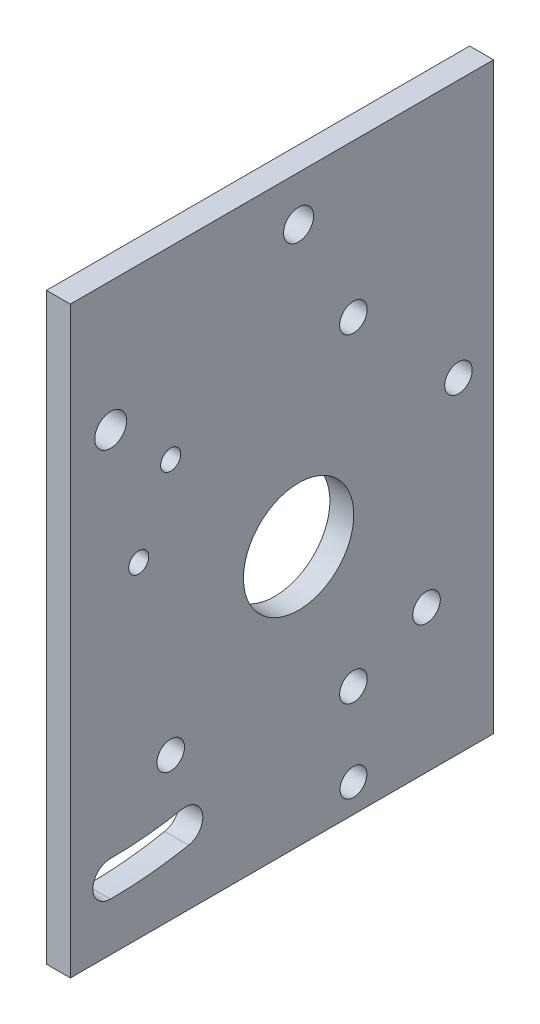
ISO-10303-21;
HEADER;
FILE_DESCRIPTION(('STEP AP214'),'2;1');
FILE_NAME('part.step','',(''),(''),'','','');
FILE_SCHEMA(('AUTOMOTIVE_DESIGN { 1 0 10303 214 1 1 1 1 }'));
ENDSEC;
DATA;
#1=APPLICATION_CONTEXT('core data for automotive mechanical design processes');
#2=APPLICATION_PROTOCOL_DEFINITION('international standard','automotive_design',2000,#1);
#3=PRODUCT_CONTEXT('',#1,'mechanical');
#4=PRODUCT('Part','Part','',(#3));
#5=PRODUCT_RELATED_PRODUCT_CATEGORY('part','',(#4));
#6=PRODUCT_DEFINITION_FORMATION('','',#4);
#7=PRODUCT_DEFINITION_CONTEXT('part definition',#1,'design');
#8=PRODUCT_DEFINITION('design','',#6,#7);
#9=PRODUCT_DEFINITION_SHAPE('','',#8);
#10=(LENGTH_UNIT() NAMED_UNIT(*) SI_UNIT(.MILLI.,.METRE.));
#11=(NAMED_UNIT(*) PLANE_ANGLE_UNIT() SI_UNIT($,.RADIAN.));
#12=(NAMED_UNIT(*) SI_UNIT($,.STERADIAN.) SOLID_ANGLE_UNIT());
#13=UNCERTAINTY_MEASURE_WITH_UNIT(LENGTH_MEASURE(1.E-05),#10,'distance_accuracy_value','');
#14=(GEOMETRIC_REPRESENTATION_CONTEXT(3) GLOBAL_UNCERTAINTY_ASSIGNED_CONTEXT((#13)) GLOBAL_UNIT_ASSIGNED_CONTEXT((#10,
#11,#12)) REPRESENTATION_CONTEXT('',''));
#15=CARTESIAN_POINT('',(0.,0.,0.));
#16=DIRECTION('',(0.,0.,1.));
#17=DIRECTION('',(1.,0.,0.));
#18=AXIS2_PLACEMENT_3D('',#15,#16,#17);
#19=CARTESIAN_POINT('',(4.7625,-51.7435992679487,45.5069751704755));
#20=DIRECTION('',(-1.,0.,0.));
#21=DIRECTION('',(0.,0.,1.));
#22=AXIS2_PLACEMENT_3D('',#19,#20,#21);
#23=PLANE('',#22);
#24=CARTESIAN_POINT('',(4.7625,-46.1120751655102,-10.9376870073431));
#25=DIRECTION('',(1.,0.,0.));
#26=DIRECTION('',(0.,0.,-1.));
#27=AXIS2_PLACEMENT_3D('',#24,#25,#26);
#28=CIRCLE('',#27,2.67160593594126);
#29=CARTESIAN_POINT('',(4.7625,-46.1120751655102,-8.26608107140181));
#30=VERTEX_POINT('',#29);
#31=EDGE_CURVE('E125',#30,#30,#28,.T.);
#32=ORIENTED_EDGE('',*,*,#31,.F.);
#33=EDGE_LOOP('',(#32));
#34=FACE_BOUND('',#33,.T.);
#35=CARTESIAN_POINT('',(4.7625,38.886127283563,37.4682412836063));
#36=DIRECTION('',(1.,0.,0.));
#37=DIRECTION('',(0.,0.,-1.));
#38=AXIS2_PLACEMENT_3D('',#35,#36,#37);
#39=CIRCLE('',#38,3.175);
#40=CARTESIAN_POINT('',(4.7625,38.886127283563,40.6432412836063));
#41=VERTEX_POINT('',#40);
#42=EDGE_CURVE('E135',#41,#41,#39,.T.);
#43=ORIENTED_EDGE('',*,*,#42,.F.);
#44=EDGE_LOOP('',(#43));
#45=FACE_BOUND('',#44,.T.);
#46=CARTESIAN_POINT('',(4.7625,34.1370999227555,-10.9376870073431));
#47=DIRECTION('',(1.,0.,0.));
#48=DIRECTION('',(0.,0.,-1.));
#49=AXIS2_PLACEMENT_3D('',#46,#47,#48);
#50=CIRCLE('',#49,2.75);
#51=CARTESIAN_POINT('',(4.7625,34.1370999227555,-8.18768700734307));
#52=VERTEX_POINT('',#51);
#53=EDGE_CURVE('E147',#52,#52,#50,.T.);
#54=ORIENTED_EDGE('',*,*,#53,.F.);
#55=EDGE_LOOP('',(#54));
#56=FACE_BOUND('',#55,.T.);
#57=CARTESIAN_POINT('',(4.7625,13.1997869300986,31.875));
#58=DIRECTION('',(1.,0.,0.));
#59=DIRECTION('',(0.,0.,-1.));
#60=AXIS2_PLACEMENT_3D('',#57,#58,#59);
#61=CIRCLE('',#60,2.);
#62=CARTESIAN_POINT('',(4.7625,13.1997869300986,33.875));
#63=VERTEX_POINT('',#62);
#64=EDGE_CURVE('E159',#63,#63,#61,.T.);
#65=ORIENTED_EDGE('',*,*,#64,.F.);
#66=EDGE_LOOP('',(#65));
#67=FACE_BOUND('',#66,.T.);
#68=CARTESIAN_POINT('',(4.7625,-23.2379000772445,-25.5));
#69=DIRECTION('',(1.,0.,0.));
#70=DIRECTION('',(0.,0.,-1.));
#71=AXIS2_PLACEMENT_3D('',#68,#69,#70);
#72=CIRCLE('',#71,2.75000000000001);
#73=CARTESIAN_POINT('',(4.7625,-23.2379000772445,-22.75));
#74=VERTEX_POINT('',#73);
#75=EDGE_CURVE('E171',#74,#74,#72,.T.);
#76=ORIENTED_EDGE('',*,*,#75,.F.);
#77=EDGE_LOOP('',(#76));
#78=FACE_BOUND('',#77,.T.);
#79=CARTESIAN_POINT('',(4.7625,0.,0.));
#80=DIRECTION('',(1.,0.,0.));
#81=DIRECTION('',(0.,0.,-1.));
#82=AXIS2_PLACEMENT_3D('',#79,#80,#81);
#83=CIRCLE('',#82,11.);
#84=CARTESIAN_POINT('',(4.7625,0.,11.));
#85=VERTEX_POINT('',#84);
#86=EDGE_CURVE('E183',#85,#85,#83,.T.);
#87=ORIENTED_EDGE('',*,*,#86,.F.);
#88=EDGE_LOOP('',(#87));
#89=FACE_BOUND('',#88,.T.);
#90=DIRECTION('',(0.,-1.,0.));
#91=VECTOR('',#90,1.);
#92=CARTESIAN_POINT('',(4.7625,64.6163216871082,45.5069751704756));
#93=LINE('',#92,#91);
#94=CARTESIAN_POINT('',(4.7625,64.6163216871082,45.5069751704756));
#95=VERTEX_POINT('',#94);
#96=CARTESIAN_POINT('',(4.7625,-51.7435992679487,45.5069751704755));
#97=VERTEX_POINT('',#96);
#98=EDGE_CURVE('E189',#95,#97,#93,.T.);
#99=ORIENTED_EDGE('',*,*,#98,.T.);
#100=DIRECTION('',(0.,0.,-1.));
#101=VECTOR('',#100,1.);
#102=CARTESIAN_POINT('',(4.7625,-51.7435992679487,-38.8643783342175));
#103=LINE('',#102,#101);
#104=CARTESIAN_POINT('',(4.7625,-51.7435992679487,-38.8643783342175));
#105=VERTEX_POINT('',#104);
#106=EDGE_CURVE('E192',#97,#105,#103,.T.);
#107=ORIENTED_EDGE('',*,*,#106,.T.);
#108=DIRECTION('',(0.,1.,0.));
#109=VECTOR('',#108,1.);
#110=CARTESIAN_POINT('',(4.7625,64.6163216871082,-38.8643783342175));
#111=LINE('',#110,#109);
#112=CARTESIAN_POINT('',(4.7625,64.6163216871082,-38.8643783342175));
#113=VERTEX_POINT('',#112);
#114=EDGE_CURVE('E195',#105,#113,#111,.T.);
#115=ORIENTED_EDGE('',*,*,#114,.T.);
#116=DIRECTION('',(0.,0.,1.));
#117=VECTOR('',#116,1.);
#118=CARTESIAN_POINT('',(4.7625,64.6163216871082,-38.8643783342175));
#119=LINE('',#118,#117);
#120=EDGE_CURVE('E197',#113,#95,#119,.T.);
#121=ORIENTED_EDGE('',*,*,#120,.T.);
#122=EDGE_LOOP('',(#99,#107,#115,#121));
#123=FACE_BOUND('',#122,.T.);
#124=CARTESIAN_POINT('',(4.7625,27.7620999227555,25.5));
#125=DIRECTION('',(1.,0.,0.));
#126=DIRECTION('',(0.,0.,-1.));
#127=AXIS2_PLACEMENT_3D('',#124,#125,#126);
#128=CIRCLE('',#127,2.);
#129=CARTESIAN_POINT('',(4.7625,27.7620999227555,27.5));
#130=VERTEX_POINT('',#129);
#131=EDGE_CURVE('E177',#130,#130,#128,.T.);
#132=ORIENTED_EDGE('',*,*,#131,.F.);
#133=EDGE_LOOP('',(#132));
#134=FACE_BOUND('',#133,.T.);
#135=CARTESIAN_POINT('',(4.7625,13.1997869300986,-31.875));
#136=DIRECTION('',(1.,0.,0.));
#137=DIRECTION('',(0.,0.,-1.));
#138=AXIS2_PLACEMENT_3D('',#135,#136,#137);
#139=CIRCLE('',#138,2.75);
#140=CARTESIAN_POINT('',(4.7625,13.1997869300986,-29.125));
#141=VERTEX_POINT('',#140);
#142=EDGE_CURVE('E165',#141,#141,#139,.T.);
#143=ORIENTED_EDGE('',*,*,#142,.F.);
#144=EDGE_LOOP('',(#143));
#145=FACE_BOUND('',#144,.T.);
#146=CARTESIAN_POINT('',(4.7625,-23.2379000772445,25.5));
#147=DIRECTION('',(1.,0.,0.));
#148=DIRECTION('',(0.,0.,-1.));
#149=AXIS2_PLACEMENT_3D('',#146,#147,#148);
#150=CIRCLE('',#149,2.75000000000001);
#151=CARTESIAN_POINT('',(4.7625,-23.2379000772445,28.25));
#152=VERTEX_POINT('',#151);
#153=EDGE_CURVE('E153',#152,#152,#150,.T.);
#154=ORIENTED_EDGE('',*,*,#153,.F.);
#155=EDGE_LOOP('',(#154));
#156=FACE_BOUND('',#155,.T.);
#157=CARTESIAN_POINT('',(4.7625,-29.6129000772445,-10.9376870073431));
#158=DIRECTION('',(1.,0.,0.));
#159=DIRECTION('',(0.,0.,-1.));
#160=AXIS2_PLACEMENT_3D('',#157,#158,#159);
#161=CIRCLE('',#160,2.75);
#162=CARTESIAN_POINT('',(4.7625,-29.6129000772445,-8.18768700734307));
#163=VERTEX_POINT('',#162);
#164=EDGE_CURVE('E141',#163,#163,#161,.T.);
#165=ORIENTED_EDGE('',*,*,#164,.F.);
#166=EDGE_LOOP('',(#165));
#167=FACE_BOUND('',#166,.T.);
#168=CARTESIAN_POINT('',(4.7625,-38.6138531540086,37.52330648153));
#169=DIRECTION('',(1.,0.,0.));
#170=DIRECTION('',(0.,0.,-1.));
#171=AXIS2_PLACEMENT_3D('',#168,#169,#170);
#172=CIRCLE('',#171,3.5);
#173=CARTESIAN_POINT('',(4.7625,-35.1138540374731,37.5208196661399));
#174=VERTEX_POINT('',#173);
#175=CARTESIAN_POINT('',(4.7625,-42.1138522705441,37.5257932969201));
#176=VERTEX_POINT('',#175);
#177=EDGE_CURVE('E96',#174,#176,#172,.T.);
#178=ORIENTED_EDGE('',*,*,#177,.F.);
#179=CARTESIAN_POINT('',(4.7625,38.886127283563,37.4682412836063));
#180=DIRECTION('',(-1.,0.,0.));
#181=DIRECTION('',(0.,0.,-1.));
#182=AXIS2_PLACEMENT_3D('',#179,#180,#181);
#183=CIRCLE('',#182,74.);
#184=CARTESIAN_POINT('',(4.7625,-33.7379268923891,23.264482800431));
#185=VERTEX_POINT('',#184);
#186=EDGE_CURVE('E119',#185,#174,#183,.T.);
#187=ORIENTED_EDGE('',*,*,#186,.F.);
#188=CARTESIAN_POINT('',(4.7625,-37.1728483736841,22.5926834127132));
#189=DIRECTION('',(1.,0.,0.));
#190=DIRECTION('',(0.,0.,-1.));
#191=AXIS2_PLACEMENT_3D('',#188,#189,#190);
#192=CIRCLE('',#191,3.5);
#193=CARTESIAN_POINT('',(4.7625,-40.6077698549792,21.9208840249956));
#194=VERTEX_POINT('',#193);
#195=EDGE_CURVE('E117',#194,#185,#192,.T.);
#196=ORIENTED_EDGE('',*,*,#195,.F.);
#197=CARTESIAN_POINT('',(4.7625,38.886127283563,37.4682412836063));
#198=DIRECTION('',(1.,0.,0.));
#199=DIRECTION('',(0.,0.,-1.));
#200=AXIS2_PLACEMENT_3D('',#197,#198,#199);
#201=CIRCLE('',#200,81.);
#202=EDGE_CURVE('E104',#176,#194,#201,.T.);
#203=ORIENTED_EDGE('',*,*,#202,.F.);
#204=EDGE_LOOP('',(#178,#187,#196,#203));
#205=FACE_BOUND('',#204,.T.);
#206=CARTESIAN_POINT('',(4.7625,55.6163216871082,0.));
#207=DIRECTION('',(1.,0.,0.));
#208=DIRECTION('',(0.,0.,-1.));
#209=AXIS2_PLACEMENT_3D('',#206,#207,#208);
#210=CIRCLE('',#209,3.);
#211=CARTESIAN_POINT('',(4.7625,55.6163216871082,3.00000000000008));
#212=VERTEX_POINT('',#211);
#213=EDGE_CURVE('E324',#212,#212,#210,.T.);
#214=ORIENTED_EDGE('',*,*,#213,.F.);
#215=EDGE_LOOP('',(#214));
#216=FACE_BOUND('',#215,.T.);
#217=ADVANCED_FACE('F31',(#34,#45,#56,#67,#78,#89,#123,#134,#145,#156,#167,#205,#216),#23,.F.);
#218=CARTESIAN_POINT('',(0.,-51.7435992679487,45.5069751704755));
#219=DIRECTION('',(-1.,0.,0.));
#220=DIRECTION('',(0.,0.,1.));
#221=AXIS2_PLACEMENT_3D('',#218,#219,#220);
#222=PLANE('',#221);
#223=CARTESIAN_POINT('',(0.,-46.1120751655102,-10.9376870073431));
#224=DIRECTION('',(1.,0.,0.));
#225=DIRECTION('',(0.,0.,-1.));
#226=AXIS2_PLACEMENT_3D('',#223,#224,#225);
#227=CIRCLE('',#226,2.67160593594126);
#228=CARTESIAN_POINT('',(0.,-46.1120751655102,-8.26608107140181));
#229=VERTEX_POINT('',#228);
#230=EDGE_CURVE('E330',#229,#229,#227,.T.);
#231=ORIENTED_EDGE('',*,*,#230,.T.);
#232=EDGE_LOOP('',(#231));
#233=FACE_BOUND('',#232,.T.);
#234=CARTESIAN_POINT('',(0.,38.886127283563,37.4682412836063));
#235=DIRECTION('',(1.,0.,0.));
#236=DIRECTION('',(0.,0.,-1.));
#237=AXIS2_PLACEMENT_3D('',#234,#235,#236);
#238=CIRCLE('',#237,3.175);
#239=CARTESIAN_POINT('',(0.,38.886127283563,40.6432412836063));
#240=VERTEX_POINT('',#239);
#241=EDGE_CURVE('E112',#240,#240,#238,.T.);
#242=ORIENTED_EDGE('',*,*,#241,.T.);
#243=EDGE_LOOP('',(#242));
#244=FACE_BOUND('',#243,.T.);
#245=CARTESIAN_POINT('',(0.,34.1370999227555,-10.9376870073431));
#246=DIRECTION('',(1.,0.,0.));
#247=DIRECTION('',(0.,0.,-1.));
#248=AXIS2_PLACEMENT_3D('',#245,#246,#247);
#249=CIRCLE('',#248,2.75);
#250=CARTESIAN_POINT('',(0.,34.1370999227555,-8.18768700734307));
#251=VERTEX_POINT('',#250);
#252=EDGE_CURVE('E144',#251,#251,#249,.T.);
#253=ORIENTED_EDGE('',*,*,#252,.T.);
#254=EDGE_LOOP('',(#253));
#255=FACE_BOUND('',#254,.T.);
#256=CARTESIAN_POINT('',(0.,13.1997869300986,31.875));
#257=DIRECTION('',(1.,0.,0.));
#258=DIRECTION('',(0.,0.,-1.));
#259=AXIS2_PLACEMENT_3D('',#256,#257,#258);
#260=CIRCLE('',#259,2.);
#261=CARTESIAN_POINT('',(0.,13.1997869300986,33.875));
#262=VERTEX_POINT('',#261);
#263=EDGE_CURVE('E156',#262,#262,#260,.T.);
#264=ORIENTED_EDGE('',*,*,#263,.T.);
#265=EDGE_LOOP('',(#264));
#266=FACE_BOUND('',#265,.T.);
#267=CARTESIAN_POINT('',(0.,-23.2379000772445,-25.5));
#268=DIRECTION('',(1.,0.,0.));
#269=DIRECTION('',(0.,0.,-1.));
#270=AXIS2_PLACEMENT_3D('',#267,#268,#269);
#271=CIRCLE('',#270,2.75000000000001);
#272=CARTESIAN_POINT('',(0.,-23.2379000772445,-22.75));
#273=VERTEX_POINT('',#272);
#274=EDGE_CURVE('E168',#273,#273,#271,.T.);
#275=ORIENTED_EDGE('',*,*,#274,.T.);
#276=EDGE_LOOP('',(#275));
#277=FACE_BOUND('',#276,.T.);
#278=CARTESIAN_POINT('',(0.,0.,0.));
#279=DIRECTION('',(1.,0.,0.));
#280=DIRECTION('',(0.,0.,-1.));
#281=AXIS2_PLACEMENT_3D('',#278,#279,#280);
#282=CIRCLE('',#281,11.);
#283=CARTESIAN_POINT('',(0.,0.,11.));
#284=VERTEX_POINT('',#283);
#285=EDGE_CURVE('E180',#284,#284,#282,.T.);
#286=ORIENTED_EDGE('',*,*,#285,.T.);
#287=EDGE_LOOP('',(#286));
#288=FACE_BOUND('',#287,.T.);
#289=DIRECTION('',(0.,-1.,0.));
#290=VECTOR('',#289,1.);
#291=CARTESIAN_POINT('',(0.,64.6163216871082,45.5069751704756));
#292=LINE('',#291,#290);
#293=CARTESIAN_POINT('',(0.,64.6163216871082,45.5069751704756));
#294=VERTEX_POINT('',#293);
#295=CARTESIAN_POINT('',(0.,-51.7435992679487,45.5069751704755));
#296=VERTEX_POINT('',#295);
#297=EDGE_CURVE('E186',#294,#296,#292,.T.);
#298=ORIENTED_EDGE('',*,*,#297,.F.);
#299=DIRECTION('',(0.,0.,1.));
#300=VECTOR('',#299,1.);
#301=CARTESIAN_POINT('',(0.,64.6163216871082,-38.8643783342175));
#302=LINE('',#301,#300);
#303=CARTESIAN_POINT('',(0.,64.6163216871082,-38.8643783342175));
#304=VERTEX_POINT('',#303);
#305=EDGE_CURVE('E193',#304,#294,#302,.T.);
#306=ORIENTED_EDGE('',*,*,#305,.F.);
#307=DIRECTION('',(0.,1.,0.));
#308=VECTOR('',#307,1.);
#309=CARTESIAN_POINT('',(0.,64.6163216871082,-38.8643783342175));
#310=LINE('',#309,#308);
#311=CARTESIAN_POINT('',(0.,-51.7435992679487,-38.8643783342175));
#312=VERTEX_POINT('',#311);
#313=EDGE_CURVE('E204',#312,#304,#310,.T.);
#314=ORIENTED_EDGE('',*,*,#313,.F.);
#315=DIRECTION('',(0.,0.,-1.));
#316=VECTOR('',#315,1.);
#317=CARTESIAN_POINT('',(0.,-51.7435992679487,-38.8643783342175));
#318=LINE('',#317,#316);
#319=EDGE_CURVE('E202',#296,#312,#318,.T.);
#320=ORIENTED_EDGE('',*,*,#319,.F.);
#321=EDGE_LOOP('',(#298,#306,#314,#320));
#322=FACE_BOUND('',#321,.T.);
#323=CARTESIAN_POINT('',(0.,27.7620999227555,25.5));
#324=DIRECTION('',(1.,0.,0.));
#325=DIRECTION('',(0.,0.,-1.));
#326=AXIS2_PLACEMENT_3D('',#323,#324,#325);
#327=CIRCLE('',#326,2.);
#328=CARTESIAN_POINT('',(0.,27.7620999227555,27.5));
#329=VERTEX_POINT('',#328);
#330=EDGE_CURVE('E174',#329,#329,#327,.T.);
#331=ORIENTED_EDGE('',*,*,#330,.T.);
#332=EDGE_LOOP('',(#331));
#333=FACE_BOUND('',#332,.T.);
#334=CARTESIAN_POINT('',(0.,13.1997869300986,-31.875));
#335=DIRECTION('',(1.,0.,0.));
#336=DIRECTION('',(0.,0.,-1.));
#337=AXIS2_PLACEMENT_3D('',#334,#335,#336);
#338=CIRCLE('',#337,2.75);
#339=CARTESIAN_POINT('',(0.,13.1997869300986,-29.125));
#340=VERTEX_POINT('',#339);
#341=EDGE_CURVE('E162',#340,#340,#338,.T.);
#342=ORIENTED_EDGE('',*,*,#341,.T.);
#343=EDGE_LOOP('',(#342));
#344=FACE_BOUND('',#343,.T.);
#345=CARTESIAN_POINT('',(0.,-23.2379000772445,25.5));
#346=DIRECTION('',(1.,0.,0.));
#347=DIRECTION('',(0.,0.,-1.));
#348=AXIS2_PLACEMENT_3D('',#345,#346,#347);
#349=CIRCLE('',#348,2.75000000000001);
#350=CARTESIAN_POINT('',(0.,-23.2379000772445,28.25));
#351=VERTEX_POINT('',#350);
#352=EDGE_CURVE('E150',#351,#351,#349,.T.);
#353=ORIENTED_EDGE('',*,*,#352,.T.);
#354=EDGE_LOOP('',(#353));
#355=FACE_BOUND('',#354,.T.);
#356=CARTESIAN_POINT('',(0.,-29.6129000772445,-10.9376870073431));
#357=DIRECTION('',(1.,0.,0.));
#358=DIRECTION('',(0.,0.,-1.));
#359=AXIS2_PLACEMENT_3D('',#356,#357,#358);
#360=CIRCLE('',#359,2.75);
#361=CARTESIAN_POINT('',(0.,-29.6129000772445,-8.18768700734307));
#362=VERTEX_POINT('',#361);
#363=EDGE_CURVE('E138',#362,#362,#360,.T.);
#364=ORIENTED_EDGE('',*,*,#363,.T.);
#365=EDGE_LOOP('',(#364));
#366=FACE_BOUND('',#365,.T.);
#367=CARTESIAN_POINT('',(0.,38.886127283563,37.4682412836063));
#368=DIRECTION('',(-1.,0.,0.));
#369=DIRECTION('',(0.,0.,-1.));
#370=AXIS2_PLACEMENT_3D('',#367,#368,#369);
#371=CIRCLE('',#370,74.);
#372=CARTESIAN_POINT('',(0.,-33.7379268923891,23.264482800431));
#373=VERTEX_POINT('',#372);
#374=CARTESIAN_POINT('',(0.,-35.1138540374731,37.5208196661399));
#375=VERTEX_POINT('',#374);
#376=EDGE_CURVE('E105',#373,#375,#371,.T.);
#377=ORIENTED_EDGE('',*,*,#376,.T.);
#378=CARTESIAN_POINT('',(0.,-38.6138531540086,37.52330648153));
#379=DIRECTION('',(1.,0.,0.));
#380=DIRECTION('',(0.,0.,-1.));
#381=AXIS2_PLACEMENT_3D('',#378,#379,#380);
#382=CIRCLE('',#381,3.5);
#383=CARTESIAN_POINT('',(0.,-42.1138522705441,37.5257932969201));
#384=VERTEX_POINT('',#383);
#385=EDGE_CURVE('E54',#375,#384,#382,.T.);
#386=ORIENTED_EDGE('',*,*,#385,.T.);
#387=CARTESIAN_POINT('',(0.,38.886127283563,37.4682412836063));
#388=DIRECTION('',(1.,0.,0.));
#389=DIRECTION('',(0.,0.,-1.));
#390=AXIS2_PLACEMENT_3D('',#387,#388,#389);
#391=CIRCLE('',#390,81.);
#392=CARTESIAN_POINT('',(0.,-40.6077698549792,21.9208840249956));
#393=VERTEX_POINT('',#392);
#394=EDGE_CURVE('E111',#384,#393,#391,.T.);
#395=ORIENTED_EDGE('',*,*,#394,.T.);
#396=CARTESIAN_POINT('',(0.,-37.1728483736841,22.5926834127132));
#397=DIRECTION('',(1.,0.,0.));
#398=DIRECTION('',(0.,0.,-1.));
#399=AXIS2_PLACEMENT_3D('',#396,#397,#398);
#400=CIRCLE('',#399,3.5);
#401=EDGE_CURVE('E127',#393,#373,#400,.T.);
#402=ORIENTED_EDGE('',*,*,#401,.T.);
#403=EDGE_LOOP('',(#377,#386,#395,#402));
#404=FACE_BOUND('',#403,.T.);
#405=CARTESIAN_POINT('',(0.,55.6163216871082,0.));
#406=DIRECTION('',(1.,0.,0.));
#407=DIRECTION('',(0.,0.,-1.));
#408=AXIS2_PLACEMENT_3D('',#405,#406,#407);
#409=CIRCLE('',#408,3.);
#410=CARTESIAN_POINT('',(0.,55.6163216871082,3.00000000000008));
#411=VERTEX_POINT('',#410);
#412=EDGE_CURVE('E327',#411,#411,#409,.T.);
#413=ORIENTED_EDGE('',*,*,#412,.T.);
#414=EDGE_LOOP('',(#413));
#415=FACE_BOUND('',#414,.T.);
#416=ADVANCED_FACE('F222',(#233,#244,#255,#266,#277,#288,#322,#333,#344,#355,#366,#404,#415),
#222,.T.);
#417=CARTESIAN_POINT('',(4.7625,64.6163216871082,45.5069751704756));
#418=DIRECTION('',(0.,0.,-1.));
#419=DIRECTION('',(0.,1.,0.));
#420=AXIS2_PLACEMENT_3D('',#417,#418,#419);
#421=PLANE('',#420);
#422=ORIENTED_EDGE('',*,*,#297,.T.);
#423=DIRECTION('',(-1.,0.,0.));
#424=VECTOR('',#423,1.);
#425=CARTESIAN_POINT('',(4.7625,-51.7435992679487,45.5069751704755));
#426=LINE('',#425,#424);
#427=EDGE_CURVE('E11',#97,#296,#426,.T.);
#428=ORIENTED_EDGE('',*,*,#427,.F.);
#429=ORIENTED_EDGE('',*,*,#98,.F.);
#430=DIRECTION('',(-1.,0.,0.));
#431=VECTOR('',#430,1.);
#432=CARTESIAN_POINT('',(4.7625,64.6163216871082,45.5069751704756));
#433=LINE('',#432,#431);
#434=EDGE_CURVE('E199',#95,#294,#433,.T.);
#435=ORIENTED_EDGE('',*,*,#434,.T.);
#436=EDGE_LOOP('',(#422,#428,#429,#435));
#437=FACE_BOUND('',#436,.T.);
#438=ADVANCED_FACE('F33',(#437),#421,.F.);
#439=CARTESIAN_POINT('',(4.7625,-51.7435992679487,-38.8643783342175));
#440=DIRECTION('',(0.,1.,0.));
#441=DIRECTION('',(0.,0.,1.));
#442=AXIS2_PLACEMENT_3D('',#439,#440,#441);
#443=PLANE('',#442);
#444=ORIENTED_EDGE('',*,*,#319,.T.);
#445=DIRECTION('',(-1.,0.,0.));
#446=VECTOR('',#445,1.);
#447=CARTESIAN_POINT('',(4.7625,-51.7435992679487,-38.8643783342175));
#448=LINE('',#447,#446);
#449=EDGE_CURVE('E39',#105,#312,#448,.T.);
#450=ORIENTED_EDGE('',*,*,#449,.F.);
#451=ORIENTED_EDGE('',*,*,#106,.F.);
#452=ORIENTED_EDGE('',*,*,#427,.T.);
#453=EDGE_LOOP('',(#444,#450,#451,#452));
#454=FACE_BOUND('',#453,.T.);
#455=ADVANCED_FACE('F233',(#454),#443,.F.);
#456=CARTESIAN_POINT('',(4.7625,64.6163216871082,-38.8643783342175));
#457=DIRECTION('',(0.,0.,1.));
#458=DIRECTION('',(0.,-1.,0.));
#459=AXIS2_PLACEMENT_3D('',#456,#457,#458);
#460=PLANE('',#459);
#461=ORIENTED_EDGE('',*,*,#313,.T.);
#462=DIRECTION('',(-1.,0.,0.));
#463=VECTOR('',#462,1.);
#464=CARTESIAN_POINT('',(4.7625,64.6163216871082,-38.8643783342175));
#465=LINE('',#464,#463);
#466=EDGE_CURVE('E209',#113,#304,#465,.T.);
#467=ORIENTED_EDGE('',*,*,#466,.F.);
#468=ORIENTED_EDGE('',*,*,#114,.F.);
#469=ORIENTED_EDGE('',*,*,#449,.T.);
#470=EDGE_LOOP('',(#461,#467,#468,#469));
#471=FACE_BOUND('',#470,.T.);
#472=ADVANCED_FACE('F216',(#471),#460,.F.);
#473=CARTESIAN_POINT('',(4.7625,64.6163216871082,-38.8643783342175));
#474=DIRECTION('',(0.,-1.,0.));
#475=DIRECTION('',(0.,0.,-1.));
#476=AXIS2_PLACEMENT_3D('',#473,#474,#475);
#477=PLANE('',#476);
#478=ORIENTED_EDGE('',*,*,#305,.T.);
#479=ORIENTED_EDGE('',*,*,#434,.F.);
#480=ORIENTED_EDGE('',*,*,#120,.F.);
#481=ORIENTED_EDGE('',*,*,#466,.T.);
#482=EDGE_LOOP('',(#478,#479,#480,#481));
#483=FACE_BOUND('',#482,.T.);
#484=ADVANCED_FACE('F226',(#483),#477,.F.);
#485=CARTESIAN_POINT('',(4.7625,0.,0.));
#486=DIRECTION('',(-1.,0.,0.));
#487=DIRECTION('',(0.,0.,1.));
#488=AXIS2_PLACEMENT_3D('',#485,#486,#487);
#489=CYLINDRICAL_SURFACE('',#488,11.);
#490=CARTESIAN_POINT('',(4.7625,0.,11.));
#491=CARTESIAN_POINT('',(4.712890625,0.,11.));
#492=CARTESIAN_POINT('',(4.66328125,0.,11.));
#493=CARTESIAN_POINT('',(4.5640625,0.,11.));
#494=CARTESIAN_POINT('',(4.514453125,0.,11.));
#495=CARTESIAN_POINT('',(4.415234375,0.,11.));
#496=CARTESIAN_POINT('',(4.365625,0.,11.));
#497=CARTESIAN_POINT('',(4.26640625,0.,11.));
#498=CARTESIAN_POINT('',(4.216796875,0.,11.));
#499=CARTESIAN_POINT('',(4.117578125,0.,11.));
#500=CARTESIAN_POINT('',(4.06796875,0.,11.));
#501=CARTESIAN_POINT('',(3.96875,0.,11.));
#502=CARTESIAN_POINT('',(3.919140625,0.,11.));
#503=CARTESIAN_POINT('',(3.819921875,0.,11.));
#504=CARTESIAN_POINT('',(3.7703125,0.,11.));
#505=CARTESIAN_POINT('',(3.67109375,0.,11.));
#506=CARTESIAN_POINT('',(3.621484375,0.,11.));
#507=CARTESIAN_POINT('',(3.522265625,0.,11.));
#508=CARTESIAN_POINT('',(3.47265625,0.,11.));
#509=CARTESIAN_POINT('',(3.3734375,0.,11.));
#510=CARTESIAN_POINT('',(3.323828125,0.,11.));
#511=CARTESIAN_POINT('',(3.224609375,0.,11.));
#512=CARTESIAN_POINT('',(3.175,0.,11.));
#513=CARTESIAN_POINT('',(3.07578125,0.,11.));
#514=CARTESIAN_POINT('',(3.026171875,0.,11.));
#515=CARTESIAN_POINT('',(2.926953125,0.,11.));
#516=CARTESIAN_POINT('',(2.87734375,0.,11.));
#517=CARTESIAN_POINT('',(2.778125,0.,11.));
#518=CARTESIAN_POINT('',(2.728515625,0.,11.));
#519=CARTESIAN_POINT('',(2.629296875,0.,11.));
#520=CARTESIAN_POINT('',(2.5796875,0.,11.));
#521=CARTESIAN_POINT('',(2.48046875,0.,11.));
#522=CARTESIAN_POINT('',(2.430859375,0.,11.));
#523=CARTESIAN_POINT('',(2.331640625,0.,11.));
#524=CARTESIAN_POINT('',(2.28203125,0.,11.));
#525=CARTESIAN_POINT('',(2.1828125,0.,11.));
#526=CARTESIAN_POINT('',(2.133203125,0.,11.));
#527=CARTESIAN_POINT('',(2.033984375,0.,11.));
#528=CARTESIAN_POINT('',(1.984375,0.,11.));
#529=CARTESIAN_POINT('',(1.88515625,0.,11.));
#530=CARTESIAN_POINT('',(1.835546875,0.,11.));
#531=CARTESIAN_POINT('',(1.736328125,0.,11.));
#532=CARTESIAN_POINT('',(1.68671875,0.,11.));
#533=CARTESIAN_POINT('',(1.5875,0.,11.));
#534=CARTESIAN_POINT('',(1.537890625,0.,11.));
#535=CARTESIAN_POINT('',(1.438671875,0.,11.));
#536=CARTESIAN_POINT('',(1.3890625,0.,11.));
#537=CARTESIAN_POINT('',(1.28984375,0.,11.));
#538=CARTESIAN_POINT('',(1.240234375,0.,11.));
#539=CARTESIAN_POINT('',(1.141015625,0.,11.));
#540=CARTESIAN_POINT('',(1.09140625,0.,11.));
#541=CARTESIAN_POINT('',(0.992187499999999,0.,11.));
#542=CARTESIAN_POINT('',(0.942578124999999,0.,11.));
#543=CARTESIAN_POINT('',(0.843359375,0.,11.));
#544=CARTESIAN_POINT('',(0.79375,0.,11.));
#545=CARTESIAN_POINT('',(0.69453125,0.,11.));
#546=CARTESIAN_POINT('',(0.644921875,0.,11.));
#547=CARTESIAN_POINT('',(0.545703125,0.,11.));
#548=CARTESIAN_POINT('',(0.49609375,0.,11.));
#549=CARTESIAN_POINT('',(0.396875,0.,11.));
#550=CARTESIAN_POINT('',(0.347265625,0.,11.));
#551=CARTESIAN_POINT('',(0.248046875,0.,11.));
#552=CARTESIAN_POINT('',(0.1984375,0.,11.));
#553=CARTESIAN_POINT('',(0.09921875,0.,11.));
#554=CARTESIAN_POINT('',(0.049609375,0.,11.));
#555=CARTESIAN_POINT('',(0.,0.,11.));
#556=B_SPLINE_CURVE_WITH_KNOTS('',3,(#490,#491,#492,#493,#494,#495,#496,#497,#498,#499,#500,
#501,#502,#503,#504,#505,#506,#507,#508,#509,#510,#511,#512,#513,#514,#515,#516,#517,#518,#519,
#520,#521,#522,#523,#524,#525,#526,#527,#528,#529,#530,#531,#532,#533,#534,#535,#536,#537,#538,
#539,#540,#541,#542,#543,#544,#545,#546,#547,#548,#549,#550,#551,#552,#553,#554,#555),
.UNSPECIFIED.,.F.,.F.,(4,2,2,2,2,2,2,2,2,2,2,2,2,2,2,2,2,2,2,2,2,2,2,2,2,2,2,2,2,2,2,2,4),(0.,
0.148828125,0.29765625,0.446484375,0.5953125,0.744140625,0.892968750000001,1.041796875,1.190625,
1.339453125,1.48828125,1.637109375,1.7859375,1.934765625,2.08359375,2.232421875,2.38125,
2.530078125,2.67890625,2.827734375,2.9765625,3.125390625,3.27421875,3.423046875,3.571875,
3.720703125,3.86953125,4.018359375,4.1671875,4.316015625,4.46484375,4.613671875,4.7625),.UNSPECIFIED.);
#557=EDGE_CURVE('BSEAM251',#85,#284,#556,.T.);
#558=ORIENTED_EDGE('',*,*,#86,.T.);
#559=ORIENTED_EDGE('',*,*,#285,.F.);
#560=ORIENTED_EDGE('',*,*,#557,.T.);
#561=ORIENTED_EDGE('',*,*,#557,.F.);
#562=EDGE_LOOP('',(#558,#560,#559,#561));
#563=FACE_BOUND('',#562,.T.);
#564=ADVANCED_FACE('F251',(#563),#489,.F.);
#565=CARTESIAN_POINT('',(4.7625,27.7620999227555,25.5));
#566=DIRECTION('',(-1.,0.,0.));
#567=DIRECTION('',(0.,0.,1.));
#568=AXIS2_PLACEMENT_3D('',#565,#566,#567);
#569=CYLINDRICAL_SURFACE('',#568,2.);
#570=CARTESIAN_POINT('',(4.7625,27.7620999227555,27.5));
#571=CARTESIAN_POINT('',(4.712890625,27.7620999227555,27.5));
#572=CARTESIAN_POINT('',(4.66328125,27.7620999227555,27.5));
#573=CARTESIAN_POINT('',(4.5640625,27.7620999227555,27.5));
#574=CARTESIAN_POINT('',(4.514453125,27.7620999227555,27.5));
#575=CARTESIAN_POINT('',(4.415234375,27.7620999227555,27.5));
#576=CARTESIAN_POINT('',(4.365625,27.7620999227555,27.5));
#577=CARTESIAN_POINT('',(4.26640625,27.7620999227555,27.5));
#578=CARTESIAN_POINT('',(4.216796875,27.7620999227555,27.5));
#579=CARTESIAN_POINT('',(4.117578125,27.7620999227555,27.5));
#580=CARTESIAN_POINT('',(4.06796875,27.7620999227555,27.5));
#581=CARTESIAN_POINT('',(3.96875,27.7620999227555,27.5));
#582=CARTESIAN_POINT('',(3.919140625,27.7620999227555,27.5));
#583=CARTESIAN_POINT('',(3.819921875,27.7620999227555,27.5));
#584=CARTESIAN_POINT('',(3.7703125,27.7620999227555,27.5));
#585=CARTESIAN_POINT('',(3.67109375,27.7620999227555,27.5));
#586=CARTESIAN_POINT('',(3.621484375,27.7620999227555,27.5));
#587=CARTESIAN_POINT('',(3.522265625,27.7620999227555,27.5));
#588=CARTESIAN_POINT('',(3.47265625,27.7620999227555,27.5));
#589=CARTESIAN_POINT('',(3.3734375,27.7620999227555,27.5));
#590=CARTESIAN_POINT('',(3.323828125,27.7620999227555,27.5));
#591=CARTESIAN_POINT('',(3.224609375,27.7620999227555,27.5));
#592=CARTESIAN_POINT('',(3.175,27.7620999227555,27.5));
#593=CARTESIAN_POINT('',(3.07578125,27.7620999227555,27.5));
#594=CARTESIAN_POINT('',(3.026171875,27.7620999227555,27.5));
#595=CARTESIAN_POINT('',(2.926953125,27.7620999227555,27.5));
#596=CARTESIAN_POINT('',(2.87734375,27.7620999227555,27.5));
#597=CARTESIAN_POINT('',(2.778125,27.7620999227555,27.5));
#598=CARTESIAN_POINT('',(2.728515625,27.7620999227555,27.5));
#599=CARTESIAN_POINT('',(2.629296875,27.7620999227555,27.5));
#600=CARTESIAN_POINT('',(2.5796875,27.7620999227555,27.5));
#601=CARTESIAN_POINT('',(2.48046875,27.7620999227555,27.5));
#602=CARTESIAN_POINT('',(2.430859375,27.7620999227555,27.5));
#603=CARTESIAN_POINT('',(2.331640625,27.7620999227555,27.5));
#604=CARTESIAN_POINT('',(2.28203125,27.7620999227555,27.5));
#605=CARTESIAN_POINT('',(2.1828125,27.7620999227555,27.5));
#606=CARTESIAN_POINT('',(2.133203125,27.7620999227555,27.5));
#607=CARTESIAN_POINT('',(2.033984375,27.7620999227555,27.5));
#608=CARTESIAN_POINT('',(1.984375,27.7620999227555,27.5));
#609=CARTESIAN_POINT('',(1.88515625,27.7620999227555,27.5));
#610=CARTESIAN_POINT('',(1.835546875,27.7620999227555,27.5));
#611=CARTESIAN_POINT('',(1.736328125,27.7620999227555,27.5));
#612=CARTESIAN_POINT('',(1.68671875,27.7620999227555,27.5));
#613=CARTESIAN_POINT('',(1.5875,27.7620999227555,27.5));
#614=CARTESIAN_POINT('',(1.537890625,27.7620999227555,27.5));
#615=CARTESIAN_POINT('',(1.438671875,27.7620999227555,27.5));
#616=CARTESIAN_POINT('',(1.3890625,27.7620999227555,27.5));
#617=CARTESIAN_POINT('',(1.28984375,27.7620999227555,27.5));
#618=CARTESIAN_POINT('',(1.240234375,27.7620999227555,27.5));
#619=CARTESIAN_POINT('',(1.141015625,27.7620999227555,27.5));
#620=CARTESIAN_POINT('',(1.09140625,27.7620999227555,27.5));
#621=CARTESIAN_POINT('',(0.9921875,27.7620999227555,27.5));
#622=CARTESIAN_POINT('',(0.942578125,27.7620999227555,27.5));
#623=CARTESIAN_POINT('',(0.843359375,27.7620999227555,27.5));
#624=CARTESIAN_POINT('',(0.79375,27.7620999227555,27.5));
#625=CARTESIAN_POINT('',(0.69453125,27.7620999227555,27.5));
#626=CARTESIAN_POINT('',(0.644921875,27.7620999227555,27.5));
#627=CARTESIAN_POINT('',(0.545703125,27.7620999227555,27.5));
#628=CARTESIAN_POINT('',(0.49609375,27.7620999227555,27.5));
#629=CARTESIAN_POINT('',(0.396875,27.7620999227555,27.5));
#630=CARTESIAN_POINT('',(0.347265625,27.7620999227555,27.5));
#631=CARTESIAN_POINT('',(0.248046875,27.7620999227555,27.5));
#632=CARTESIAN_POINT('',(0.1984375,27.7620999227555,27.5));
#633=CARTESIAN_POINT('',(0.09921875,27.7620999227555,27.5));
#634=CARTESIAN_POINT('',(0.049609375,27.7620999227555,27.5));
#635=CARTESIAN_POINT('',(0.,27.7620999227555,27.5));
#636=B_SPLINE_CURVE_WITH_KNOTS('',3,(#570,#571,#572,#573,#574,#575,#576,#577,#578,#579,#580,
#581,#582,#583,#584,#585,#586,#587,#588,#589,#590,#591,#592,#593,#594,#595,#596,#597,#598,#599,
#600,#601,#602,#603,#604,#605,#606,#607,#608,#609,#610,#611,#612,#613,#614,#615,#616,#617,#618,
#619,#620,#621,#622,#623,#624,#625,#626,#627,#628,#629,#630,#631,#632,#633,#634,#635),
.UNSPECIFIED.,.F.,.F.,(4,2,2,2,2,2,2,2,2,2,2,2,2,2,2,2,2,2,2,2,2,2,2,2,2,2,2,2,2,2,2,2,4),(0.,
0.148828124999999,0.297656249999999,0.446484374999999,0.595312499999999,0.744140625,0.89296875,
1.041796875,1.190625,1.339453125,1.48828125,1.637109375,1.7859375,1.934765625,2.08359375,
2.232421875,2.38125,2.530078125,2.67890625,2.827734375,2.9765625,3.125390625,3.27421875,
3.423046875,3.571875,3.720703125,3.86953125,4.018359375,4.1671875,4.316015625,4.46484375,
4.613671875,4.7625),.UNSPECIFIED.);
#637=EDGE_CURVE('BSEAM258',#130,#329,#636,.T.);
#638=ORIENTED_EDGE('',*,*,#131,.T.);
#639=ORIENTED_EDGE('',*,*,#330,.F.);
#640=ORIENTED_EDGE('',*,*,#637,.T.);
#641=ORIENTED_EDGE('',*,*,#637,.F.);
#642=EDGE_LOOP('',(#638,#640,#639,#641));
#643=FACE_BOUND('',#642,.T.);
#644=ADVANCED_FACE('F258',(#643),#569,.F.);
#645=CARTESIAN_POINT('',(4.7625,-23.2379000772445,-25.5));
#646=DIRECTION('',(-1.,0.,0.));
#647=DIRECTION('',(0.,0.,1.));
#648=AXIS2_PLACEMENT_3D('',#645,#646,#647);
#649=CYLINDRICAL_SURFACE('',#648,2.75000000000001);
#650=CARTESIAN_POINT('',(4.7625,-23.2379000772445,-22.75));
#651=CARTESIAN_POINT('',(4.712890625,-23.2379000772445,-22.75));
#652=CARTESIAN_POINT('',(4.66328125,-23.2379000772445,-22.75));
#653=CARTESIAN_POINT('',(4.5640625,-23.2379000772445,-22.75));
#654=CARTESIAN_POINT('',(4.514453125,-23.2379000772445,-22.75));
#655=CARTESIAN_POINT('',(4.415234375,-23.2379000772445,-22.75));
#656=CARTESIAN_POINT('',(4.365625,-23.2379000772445,-22.75));
#657=CARTESIAN_POINT('',(4.26640625,-23.2379000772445,-22.75));
#658=CARTESIAN_POINT('',(4.216796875,-23.2379000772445,-22.75));
#659=CARTESIAN_POINT('',(4.117578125,-23.2379000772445,-22.75));
#660=CARTESIAN_POINT('',(4.06796875,-23.2379000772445,-22.75));
#661=CARTESIAN_POINT('',(3.96875,-23.2379000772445,-22.75));
#662=CARTESIAN_POINT('',(3.919140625,-23.2379000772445,-22.75));
#663=CARTESIAN_POINT('',(3.819921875,-23.2379000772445,-22.75));
#664=CARTESIAN_POINT('',(3.7703125,-23.2379000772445,-22.75));
#665=CARTESIAN_POINT('',(3.67109375,-23.2379000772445,-22.75));
#666=CARTESIAN_POINT('',(3.621484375,-23.2379000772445,-22.75));
#667=CARTESIAN_POINT('',(3.522265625,-23.2379000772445,-22.75));
#668=CARTESIAN_POINT('',(3.47265625,-23.2379000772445,-22.75));
#669=CARTESIAN_POINT('',(3.3734375,-23.2379000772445,-22.75));
#670=CARTESIAN_POINT('',(3.323828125,-23.2379000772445,-22.75));
#671=CARTESIAN_POINT('',(3.224609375,-23.2379000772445,-22.75));
#672=CARTESIAN_POINT('',(3.175,-23.2379000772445,-22.75));
#673=CARTESIAN_POINT('',(3.07578125,-23.2379000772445,-22.75));
#674=CARTESIAN_POINT('',(3.026171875,-23.2379000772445,-22.75));
#675=CARTESIAN_POINT('',(2.926953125,-23.2379000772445,-22.75));
#676=CARTESIAN_POINT('',(2.87734375,-23.2379000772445,-22.75));
#677=CARTESIAN_POINT('',(2.778125,-23.2379000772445,-22.75));
#678=CARTESIAN_POINT('',(2.728515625,-23.2379000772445,-22.75));
#679=CARTESIAN_POINT('',(2.629296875,-23.2379000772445,-22.75));
#680=CARTESIAN_POINT('',(2.5796875,-23.2379000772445,-22.75));
#681=CARTESIAN_POINT('',(2.48046875,-23.2379000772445,-22.75));
#682=CARTESIAN_POINT('',(2.430859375,-23.2379000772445,-22.75));
#683=CARTESIAN_POINT('',(2.331640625,-23.2379000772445,-22.75));
#684=CARTESIAN_POINT('',(2.28203125,-23.2379000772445,-22.75));
#685=CARTESIAN_POINT('',(2.1828125,-23.2379000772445,-22.75));
#686=CARTESIAN_POINT('',(2.133203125,-23.2379000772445,-22.75));
#687=CARTESIAN_POINT('',(2.033984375,-23.2379000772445,-22.75));
#688=CARTESIAN_POINT('',(1.984375,-23.2379000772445,-22.75));
#689=CARTESIAN_POINT('',(1.88515625,-23.2379000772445,-22.75));
#690=CARTESIAN_POINT('',(1.835546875,-23.2379000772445,-22.75));
#691=CARTESIAN_POINT('',(1.736328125,-23.2379000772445,-22.75));
#692=CARTESIAN_POINT('',(1.68671875,-23.2379000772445,-22.75));
#693=CARTESIAN_POINT('',(1.5875,-23.2379000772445,-22.75));
#694=CARTESIAN_POINT('',(1.537890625,-23.2379000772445,-22.75));
#695=CARTESIAN_POINT('',(1.438671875,-23.2379000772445,-22.75));
#696=CARTESIAN_POINT('',(1.3890625,-23.2379000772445,-22.75));
#697=CARTESIAN_POINT('',(1.28984375,-23.2379000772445,-22.75));
#698=CARTESIAN_POINT('',(1.240234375,-23.2379000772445,-22.75));
#699=CARTESIAN_POINT('',(1.141015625,-23.2379000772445,-22.75));
#700=CARTESIAN_POINT('',(1.09140625,-23.2379000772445,-22.75));
#701=CARTESIAN_POINT('',(0.9921875,-23.2379000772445,-22.75));
#702=CARTESIAN_POINT('',(0.942578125,-23.2379000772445,-22.75));
#703=CARTESIAN_POINT('',(0.843359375,-23.2379000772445,-22.75));
#704=CARTESIAN_POINT('',(0.79375,-23.2379000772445,-22.75));
#705=CARTESIAN_POINT('',(0.69453125,-23.2379000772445,-22.75));
#706=CARTESIAN_POINT('',(0.644921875,-23.2379000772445,-22.75));
#707=CARTESIAN_POINT('',(0.545703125,-23.2379000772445,-22.75));
#708=CARTESIAN_POINT('',(0.49609375,-23.2379000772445,-22.75));
#709=CARTESIAN_POINT('',(0.396875,-23.2379000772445,-22.75));
#710=CARTESIAN_POINT('',(0.347265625,-23.2379000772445,-22.75));
#711=CARTESIAN_POINT('',(0.248046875,-23.2379000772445,-22.75));
#712=CARTESIAN_POINT('',(0.1984375,-23.2379000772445,-22.75));
#713=CARTESIAN_POINT('',(0.09921875,-23.2379000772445,-22.75));
#714=CARTESIAN_POINT('',(0.049609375,-23.2379000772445,-22.75));
#715=CARTESIAN_POINT('',(0.,-23.2379000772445,-22.75));
#716=B_SPLINE_CURVE_WITH_KNOTS('',3,(#650,#651,#652,#653,#654,#655,#656,#657,#658,#659,#660,
#661,#662,#663,#664,#665,#666,#667,#668,#669,#670,#671,#672,#673,#674,#675,#676,#677,#678,#679,
#680,#681,#682,#683,#684,#685,#686,#687,#688,#689,#690,#691,#692,#693,#694,#695,#696,#697,#698,
#699,#700,#701,#702,#703,#704,#705,#706,#707,#708,#709,#710,#711,#712,#713,#714,#715),
.UNSPECIFIED.,.F.,.F.,(4,2,2,2,2,2,2,2,2,2,2,2,2,2,2,2,2,2,2,2,2,2,2,2,2,2,2,2,2,2,2,2,4),(0.,
0.148828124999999,0.297656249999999,0.446484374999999,0.595312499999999,0.744140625,0.89296875,
1.041796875,1.190625,1.339453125,1.48828125,1.637109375,1.7859375,1.934765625,2.08359375,
2.232421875,2.38125,2.530078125,2.67890625,2.827734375,2.9765625,3.125390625,3.27421875,
3.423046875,3.571875,3.720703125,3.86953125,4.018359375,4.1671875,4.316015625,4.46484375,
4.613671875,4.7625),.UNSPECIFIED.);
#717=EDGE_CURVE('BSEAM263',#74,#273,#716,.T.);
#718=ORIENTED_EDGE('',*,*,#75,.T.);
#719=ORIENTED_EDGE('',*,*,#274,.F.);
#720=ORIENTED_EDGE('',*,*,#717,.T.);
#721=ORIENTED_EDGE('',*,*,#717,.F.);
#722=EDGE_LOOP('',(#718,#720,#719,#721));
#723=FACE_BOUND('',#722,.T.);
#724=ADVANCED_FACE('F263',(#723),#649,.F.);
#725=CARTESIAN_POINT('',(4.7625,13.1997869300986,-31.875));
#726=DIRECTION('',(-1.,0.,0.));
#727=DIRECTION('',(0.,0.,1.));
#728=AXIS2_PLACEMENT_3D('',#725,#726,#727);
#729=CYLINDRICAL_SURFACE('',#728,2.75);
#730=CARTESIAN_POINT('',(4.7625,13.1997869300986,-29.125));
#731=CARTESIAN_POINT('',(4.712890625,13.1997869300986,-29.125));
#732=CARTESIAN_POINT('',(4.66328125,13.1997869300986,-29.125));
#733=CARTESIAN_POINT('',(4.5640625,13.1997869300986,-29.125));
#734=CARTESIAN_POINT('',(4.514453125,13.1997869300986,-29.125));
#735=CARTESIAN_POINT('',(4.415234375,13.1997869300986,-29.125));
#736=CARTESIAN_POINT('',(4.365625,13.1997869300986,-29.125));
#737=CARTESIAN_POINT('',(4.26640625,13.1997869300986,-29.125));
#738=CARTESIAN_POINT('',(4.216796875,13.1997869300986,-29.125));
#739=CARTESIAN_POINT('',(4.117578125,13.1997869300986,-29.125));
#740=CARTESIAN_POINT('',(4.06796875,13.1997869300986,-29.125));
#741=CARTESIAN_POINT('',(3.96875,13.1997869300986,-29.125));
#742=CARTESIAN_POINT('',(3.919140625,13.1997869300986,-29.125));
#743=CARTESIAN_POINT('',(3.819921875,13.1997869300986,-29.125));
#744=CARTESIAN_POINT('',(3.7703125,13.1997869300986,-29.125));
#745=CARTESIAN_POINT('',(3.67109375,13.1997869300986,-29.125));
#746=CARTESIAN_POINT('',(3.621484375,13.1997869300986,-29.125));
#747=CARTESIAN_POINT('',(3.522265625,13.1997869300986,-29.125));
#748=CARTESIAN_POINT('',(3.47265625,13.1997869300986,-29.125));
#749=CARTESIAN_POINT('',(3.3734375,13.1997869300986,-29.125));
#750=CARTESIAN_POINT('',(3.323828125,13.1997869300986,-29.125));
#751=CARTESIAN_POINT('',(3.224609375,13.1997869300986,-29.125));
#752=CARTESIAN_POINT('',(3.175,13.1997869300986,-29.125));
#753=CARTESIAN_POINT('',(3.07578125,13.1997869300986,-29.125));
#754=CARTESIAN_POINT('',(3.026171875,13.1997869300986,-29.125));
#755=CARTESIAN_POINT('',(2.926953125,13.1997869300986,-29.125));
#756=CARTESIAN_POINT('',(2.87734375,13.1997869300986,-29.125));
#757=CARTESIAN_POINT('',(2.778125,13.1997869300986,-29.125));
#758=CARTESIAN_POINT('',(2.728515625,13.1997869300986,-29.125));
#759=CARTESIAN_POINT('',(2.629296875,13.1997869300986,-29.125));
#760=CARTESIAN_POINT('',(2.5796875,13.1997869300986,-29.125));
#761=CARTESIAN_POINT('',(2.48046875,13.1997869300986,-29.125));
#762=CARTESIAN_POINT('',(2.430859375,13.1997869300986,-29.125));
#763=CARTESIAN_POINT('',(2.331640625,13.1997869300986,-29.125));
#764=CARTESIAN_POINT('',(2.28203125,13.1997869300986,-29.125));
#765=CARTESIAN_POINT('',(2.1828125,13.1997869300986,-29.125));
#766=CARTESIAN_POINT('',(2.133203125,13.1997869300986,-29.125));
#767=CARTESIAN_POINT('',(2.033984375,13.1997869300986,-29.125));
#768=CARTESIAN_POINT('',(1.984375,13.1997869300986,-29.125));
#769=CARTESIAN_POINT('',(1.88515625,13.1997869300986,-29.125));
#770=CARTESIAN_POINT('',(1.835546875,13.1997869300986,-29.125));
#771=CARTESIAN_POINT('',(1.736328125,13.1997869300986,-29.125));
#772=CARTESIAN_POINT('',(1.68671875,13.1997869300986,-29.125));
#773=CARTESIAN_POINT('',(1.5875,13.1997869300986,-29.125));
#774=CARTESIAN_POINT('',(1.537890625,13.1997869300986,-29.125));
#775=CARTESIAN_POINT('',(1.438671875,13.1997869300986,-29.125));
#776=CARTESIAN_POINT('',(1.3890625,13.1997869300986,-29.125));
#777=CARTESIAN_POINT('',(1.28984375,13.1997869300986,-29.125));
#778=CARTESIAN_POINT('',(1.240234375,13.1997869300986,-29.125));
#779=CARTESIAN_POINT('',(1.141015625,13.1997869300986,-29.125));
#780=CARTESIAN_POINT('',(1.09140625,13.1997869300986,-29.125));
#781=CARTESIAN_POINT('',(0.9921875,13.1997869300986,-29.125));
#782=CARTESIAN_POINT('',(0.942578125,13.1997869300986,-29.125));
#783=CARTESIAN_POINT('',(0.843359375,13.1997869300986,-29.125));
#784=CARTESIAN_POINT('',(0.79375,13.1997869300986,-29.125));
#785=CARTESIAN_POINT('',(0.69453125,13.1997869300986,-29.125));
#786=CARTESIAN_POINT('',(0.644921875,13.1997869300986,-29.125));
#787=CARTESIAN_POINT('',(0.545703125,13.1997869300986,-29.125));
#788=CARTESIAN_POINT('',(0.49609375,13.1997869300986,-29.125));
#789=CARTESIAN_POINT('',(0.396875,13.1997869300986,-29.125));
#790=CARTESIAN_POINT('',(0.347265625,13.1997869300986,-29.125));
#791=CARTESIAN_POINT('',(0.248046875,13.1997869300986,-29.125));
#792=CARTESIAN_POINT('',(0.1984375,13.1997869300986,-29.125));
#793=CARTESIAN_POINT('',(0.09921875,13.1997869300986,-29.125));
#794=CARTESIAN_POINT('',(0.049609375,13.1997869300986,-29.125));
#795=CARTESIAN_POINT('',(0.,13.1997869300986,-29.125));
#796=B_SPLINE_CURVE_WITH_KNOTS('',3,(#730,#731,#732,#733,#734,#735,#736,#737,#738,#739,#740,
#741,#742,#743,#744,#745,#746,#747,#748,#749,#750,#751,#752,#753,#754,#755,#756,#757,#758,#759,
#760,#761,#762,#763,#764,#765,#766,#767,#768,#769,#770,#771,#772,#773,#774,#775,#776,#777,#778,
#779,#780,#781,#782,#783,#784,#785,#786,#787,#788,#789,#790,#791,#792,#793,#794,#795),
.UNSPECIFIED.,.F.,.F.,(4,2,2,2,2,2,2,2,2,2,2,2,2,2,2,2,2,2,2,2,2,2,2,2,2,2,2,2,2,2,2,2,4),(0.,
0.148828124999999,0.297656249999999,0.446484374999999,0.595312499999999,0.744140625,0.89296875,
1.041796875,1.190625,1.339453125,1.48828125,1.637109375,1.7859375,1.934765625,2.08359375,
2.232421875,2.38125,2.530078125,2.67890625,2.827734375,2.9765625,3.125390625,3.27421875,
3.423046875,3.571875,3.720703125,3.86953125,4.018359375,4.1671875,4.316015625,4.46484375,
4.613671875,4.7625),.UNSPECIFIED.);
#797=EDGE_CURVE('BSEAM273',#141,#340,#796,.T.);
#798=ORIENTED_EDGE('',*,*,#142,.T.);
#799=ORIENTED_EDGE('',*,*,#341,.F.);
#800=ORIENTED_EDGE('',*,*,#797,.T.);
#801=ORIENTED_EDGE('',*,*,#797,.F.);
#802=EDGE_LOOP('',(#798,#800,#799,#801));
#803=FACE_BOUND('',#802,.T.);
#804=ADVANCED_FACE('F273',(#803),#729,.F.);
#805=CARTESIAN_POINT('',(4.7625,13.1997869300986,31.875));
#806=DIRECTION('',(-1.,0.,0.));
#807=DIRECTION('',(0.,0.,1.));
#808=AXIS2_PLACEMENT_3D('',#805,#806,#807);
#809=CYLINDRICAL_SURFACE('',#808,2.);
#810=CARTESIAN_POINT('',(4.7625,13.1997869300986,33.875));
#811=CARTESIAN_POINT('',(4.712890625,13.1997869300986,33.875));
#812=CARTESIAN_POINT('',(4.66328125,13.1997869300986,33.875));
#813=CARTESIAN_POINT('',(4.5640625,13.1997869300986,33.875));
#814=CARTESIAN_POINT('',(4.514453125,13.1997869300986,33.875));
#815=CARTESIAN_POINT('',(4.415234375,13.1997869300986,33.875));
#816=CARTESIAN_POINT('',(4.365625,13.1997869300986,33.875));
#817=CARTESIAN_POINT('',(4.26640625,13.1997869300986,33.875));
#818=CARTESIAN_POINT('',(4.216796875,13.1997869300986,33.875));
#819=CARTESIAN_POINT('',(4.117578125,13.1997869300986,33.875));
#820=CARTESIAN_POINT('',(4.06796875,13.1997869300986,33.875));
#821=CARTESIAN_POINT('',(3.96875,13.1997869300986,33.875));
#822=CARTESIAN_POINT('',(3.919140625,13.1997869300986,33.875));
#823=CARTESIAN_POINT('',(3.819921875,13.1997869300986,33.875));
#824=CARTESIAN_POINT('',(3.7703125,13.1997869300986,33.875));
#825=CARTESIAN_POINT('',(3.67109375,13.1997869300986,33.875));
#826=CARTESIAN_POINT('',(3.621484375,13.1997869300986,33.875));
#827=CARTESIAN_POINT('',(3.522265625,13.1997869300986,33.875));
#828=CARTESIAN_POINT('',(3.47265625,13.1997869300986,33.875));
#829=CARTESIAN_POINT('',(3.3734375,13.1997869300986,33.875));
#830=CARTESIAN_POINT('',(3.323828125,13.1997869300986,33.875));
#831=CARTESIAN_POINT('',(3.224609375,13.1997869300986,33.875));
#832=CARTESIAN_POINT('',(3.175,13.1997869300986,33.875));
#833=CARTESIAN_POINT('',(3.07578125,13.1997869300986,33.875));
#834=CARTESIAN_POINT('',(3.026171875,13.1997869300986,33.875));
#835=CARTESIAN_POINT('',(2.926953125,13.1997869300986,33.875));
#836=CARTESIAN_POINT('',(2.87734375,13.1997869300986,33.875));
#837=CARTESIAN_POINT('',(2.778125,13.1997869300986,33.875));
#838=CARTESIAN_POINT('',(2.728515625,13.1997869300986,33.875));
#839=CARTESIAN_POINT('',(2.629296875,13.1997869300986,33.875));
#840=CARTESIAN_POINT('',(2.5796875,13.1997869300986,33.875));
#841=CARTESIAN_POINT('',(2.48046875,13.1997869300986,33.875));
#842=CARTESIAN_POINT('',(2.430859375,13.1997869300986,33.875));
#843=CARTESIAN_POINT('',(2.331640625,13.1997869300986,33.875));
#844=CARTESIAN_POINT('',(2.28203125,13.1997869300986,33.875));
#845=CARTESIAN_POINT('',(2.1828125,13.1997869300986,33.875));
#846=CARTESIAN_POINT('',(2.133203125,13.1997869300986,33.875));
#847=CARTESIAN_POINT('',(2.033984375,13.1997869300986,33.875));
#848=CARTESIAN_POINT('',(1.984375,13.1997869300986,33.875));
#849=CARTESIAN_POINT('',(1.88515625,13.1997869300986,33.875));
#850=CARTESIAN_POINT('',(1.835546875,13.1997869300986,33.875));
#851=CARTESIAN_POINT('',(1.736328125,13.1997869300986,33.875));
#852=CARTESIAN_POINT('',(1.68671875,13.1997869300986,33.875));
#853=CARTESIAN_POINT('',(1.5875,13.1997869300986,33.875));
#854=CARTESIAN_POINT('',(1.537890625,13.1997869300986,33.875));
#855=CARTESIAN_POINT('',(1.438671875,13.1997869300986,33.875));
#856=CARTESIAN_POINT('',(1.3890625,13.1997869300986,33.875));
#857=CARTESIAN_POINT('',(1.28984375,13.1997869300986,33.875));
#858=CARTESIAN_POINT('',(1.240234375,13.1997869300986,33.875));
#859=CARTESIAN_POINT('',(1.141015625,13.1997869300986,33.875));
#860=CARTESIAN_POINT('',(1.09140625,13.1997869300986,33.875));
#861=CARTESIAN_POINT('',(0.9921875,13.1997869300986,33.875));
#862=CARTESIAN_POINT('',(0.942578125,13.1997869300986,33.875));
#863=CARTESIAN_POINT('',(0.843359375,13.1997869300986,33.875));
#864=CARTESIAN_POINT('',(0.79375,13.1997869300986,33.875));
#865=CARTESIAN_POINT('',(0.69453125,13.1997869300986,33.875));
#866=CARTESIAN_POINT('',(0.644921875,13.1997869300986,33.875));
#867=CARTESIAN_POINT('',(0.545703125,13.1997869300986,33.875));
#868=CARTESIAN_POINT('',(0.49609375,13.1997869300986,33.875));
#869=CARTESIAN_POINT('',(0.396875,13.1997869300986,33.875));
#870=CARTESIAN_POINT('',(0.347265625,13.1997869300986,33.875));
#871=CARTESIAN_POINT('',(0.248046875,13.1997869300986,33.875));
#872=CARTESIAN_POINT('',(0.1984375,13.1997869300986,33.875));
#873=CARTESIAN_POINT('',(0.09921875,13.1997869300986,33.875));
#874=CARTESIAN_POINT('',(0.049609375,13.1997869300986,33.875));
#875=CARTESIAN_POINT('',(0.,13.1997869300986,33.875));
#876=B_SPLINE_CURVE_WITH_KNOTS('',3,(#810,#811,#812,#813,#814,#815,#816,#817,#818,#819,#820,
#821,#822,#823,#824,#825,#826,#827,#828,#829,#830,#831,#832,#833,#834,#835,#836,#837,#838,#839,
#840,#841,#842,#843,#844,#845,#846,#847,#848,#849,#850,#851,#852,#853,#854,#855,#856,#857,#858,
#859,#860,#861,#862,#863,#864,#865,#866,#867,#868,#869,#870,#871,#872,#873,#874,#875),
.UNSPECIFIED.,.F.,.F.,(4,2,2,2,2,2,2,2,2,2,2,2,2,2,2,2,2,2,2,2,2,2,2,2,2,2,2,2,2,2,2,2,4),(0.,
0.148828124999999,0.297656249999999,0.446484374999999,0.595312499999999,0.744140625,0.89296875,
1.041796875,1.190625,1.339453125,1.48828125,1.637109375,1.7859375,1.934765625,2.08359375,
2.232421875,2.38125,2.530078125,2.67890625,2.827734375,2.9765625,3.125390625,3.27421875,
3.423046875,3.571875,3.720703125,3.86953125,4.018359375,4.1671875,4.316015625,4.46484375,
4.613671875,4.7625),.UNSPECIFIED.);
#877=EDGE_CURVE('BSEAM280',#63,#262,#876,.T.);
#878=ORIENTED_EDGE('',*,*,#64,.T.);
#879=ORIENTED_EDGE('',*,*,#263,.F.);
#880=ORIENTED_EDGE('',*,*,#877,.T.);
#881=ORIENTED_EDGE('',*,*,#877,.F.);
#882=EDGE_LOOP('',(#878,#880,#879,#881));
#883=FACE_BOUND('',#882,.T.);
#884=ADVANCED_FACE('F280',(#883),#809,.F.);
#885=CARTESIAN_POINT('',(4.7625,-23.2379000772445,25.5));
#886=DIRECTION('',(-1.,0.,0.));
#887=DIRECTION('',(0.,0.,1.));
#888=AXIS2_PLACEMENT_3D('',#885,#886,#887);
#889=CYLINDRICAL_SURFACE('',#888,2.75000000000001);
#890=CARTESIAN_POINT('',(4.7625,-23.2379000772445,28.25));
#891=CARTESIAN_POINT('',(4.712890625,-23.2379000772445,28.25));
#892=CARTESIAN_POINT('',(4.66328125,-23.2379000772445,28.25));
#893=CARTESIAN_POINT('',(4.5640625,-23.2379000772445,28.25));
#894=CARTESIAN_POINT('',(4.514453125,-23.2379000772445,28.25));
#895=CARTESIAN_POINT('',(4.415234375,-23.2379000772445,28.25));
#896=CARTESIAN_POINT('',(4.365625,-23.2379000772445,28.25));
#897=CARTESIAN_POINT('',(4.26640625,-23.2379000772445,28.25));
#898=CARTESIAN_POINT('',(4.216796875,-23.2379000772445,28.25));
#899=CARTESIAN_POINT('',(4.117578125,-23.2379000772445,28.25));
#900=CARTESIAN_POINT('',(4.06796875,-23.2379000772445,28.25));
#901=CARTESIAN_POINT('',(3.96875,-23.2379000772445,28.25));
#902=CARTESIAN_POINT('',(3.919140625,-23.2379000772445,28.25));
#903=CARTESIAN_POINT('',(3.819921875,-23.2379000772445,28.25));
#904=CARTESIAN_POINT('',(3.7703125,-23.2379000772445,28.25));
#905=CARTESIAN_POINT('',(3.67109375,-23.2379000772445,28.25));
#906=CARTESIAN_POINT('',(3.621484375,-23.2379000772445,28.25));
#907=CARTESIAN_POINT('',(3.522265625,-23.2379000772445,28.25));
#908=CARTESIAN_POINT('',(3.47265625,-23.2379000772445,28.25));
#909=CARTESIAN_POINT('',(3.3734375,-23.2379000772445,28.25));
#910=CARTESIAN_POINT('',(3.323828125,-23.2379000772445,28.25));
#911=CARTESIAN_POINT('',(3.224609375,-23.2379000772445,28.25));
#912=CARTESIAN_POINT('',(3.175,-23.2379000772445,28.25));
#913=CARTESIAN_POINT('',(3.07578125,-23.2379000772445,28.25));
#914=CARTESIAN_POINT('',(3.026171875,-23.2379000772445,28.25));
#915=CARTESIAN_POINT('',(2.926953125,-23.2379000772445,28.25));
#916=CARTESIAN_POINT('',(2.87734375,-23.2379000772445,28.25));
#917=CARTESIAN_POINT('',(2.778125,-23.2379000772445,28.25));
#918=CARTESIAN_POINT('',(2.728515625,-23.2379000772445,28.25));
#919=CARTESIAN_POINT('',(2.629296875,-23.2379000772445,28.25));
#920=CARTESIAN_POINT('',(2.5796875,-23.2379000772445,28.25));
#921=CARTESIAN_POINT('',(2.48046875,-23.2379000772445,28.25));
#922=CARTESIAN_POINT('',(2.430859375,-23.2379000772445,28.25));
#923=CARTESIAN_POINT('',(2.331640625,-23.2379000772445,28.25));
#924=CARTESIAN_POINT('',(2.28203125,-23.2379000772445,28.25));
#925=CARTESIAN_POINT('',(2.1828125,-23.2379000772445,28.25));
#926=CARTESIAN_POINT('',(2.133203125,-23.2379000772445,28.25));
#927=CARTESIAN_POINT('',(2.033984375,-23.2379000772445,28.25));
#928=CARTESIAN_POINT('',(1.984375,-23.2379000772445,28.25));
#929=CARTESIAN_POINT('',(1.88515625,-23.2379000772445,28.25));
#930=CARTESIAN_POINT('',(1.835546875,-23.2379000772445,28.25));
#931=CARTESIAN_POINT('',(1.736328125,-23.2379000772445,28.25));
#932=CARTESIAN_POINT('',(1.68671875,-23.2379000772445,28.25));
#933=CARTESIAN_POINT('',(1.5875,-23.2379000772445,28.25));
#934=CARTESIAN_POINT('',(1.537890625,-23.2379000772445,28.25));
#935=CARTESIAN_POINT('',(1.438671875,-23.2379000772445,28.25));
#936=CARTESIAN_POINT('',(1.3890625,-23.2379000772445,28.25));
#937=CARTESIAN_POINT('',(1.28984375,-23.2379000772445,28.25));
#938=CARTESIAN_POINT('',(1.240234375,-23.2379000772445,28.25));
#939=CARTESIAN_POINT('',(1.141015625,-23.2379000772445,28.25));
#940=CARTESIAN_POINT('',(1.09140625,-23.2379000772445,28.25));
#941=CARTESIAN_POINT('',(0.9921875,-23.2379000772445,28.25));
#942=CARTESIAN_POINT('',(0.942578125,-23.2379000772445,28.25));
#943=CARTESIAN_POINT('',(0.843359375,-23.2379000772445,28.25));
#944=CARTESIAN_POINT('',(0.79375,-23.2379000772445,28.25));
#945=CARTESIAN_POINT('',(0.69453125,-23.2379000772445,28.25));
#946=CARTESIAN_POINT('',(0.644921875,-23.2379000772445,28.25));
#947=CARTESIAN_POINT('',(0.545703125,-23.2379000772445,28.25));
#948=CARTESIAN_POINT('',(0.49609375,-23.2379000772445,28.25));
#949=CARTESIAN_POINT('',(0.396875,-23.2379000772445,28.25));
#950=CARTESIAN_POINT('',(0.347265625,-23.2379000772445,28.25));
#951=CARTESIAN_POINT('',(0.248046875,-23.2379000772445,28.25));
#952=CARTESIAN_POINT('',(0.1984375,-23.2379000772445,28.25));
#953=CARTESIAN_POINT('',(0.09921875,-23.2379000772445,28.25));
#954=CARTESIAN_POINT('',(0.049609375,-23.2379000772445,28.25));
#955=CARTESIAN_POINT('',(0.,-23.2379000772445,28.25));
#956=B_SPLINE_CURVE_WITH_KNOTS('',3,(#890,#891,#892,#893,#894,#895,#896,#897,#898,#899,#900,
#901,#902,#903,#904,#905,#906,#907,#908,#909,#910,#911,#912,#913,#914,#915,#916,#917,#918,#919,
#920,#921,#922,#923,#924,#925,#926,#927,#928,#929,#930,#931,#932,#933,#934,#935,#936,#937,#938,
#939,#940,#941,#942,#943,#944,#945,#946,#947,#948,#949,#950,#951,#952,#953,#954,#955),
.UNSPECIFIED.,.F.,.F.,(4,2,2,2,2,2,2,2,2,2,2,2,2,2,2,2,2,2,2,2,2,2,2,2,2,2,2,2,2,2,2,2,4),(0.,
0.148828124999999,0.297656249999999,0.446484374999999,0.595312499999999,0.744140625,0.89296875,
1.041796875,1.190625,1.339453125,1.48828125,1.637109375,1.7859375,1.934765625,2.08359375,
2.232421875,2.38125,2.530078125,2.67890625,2.827734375,2.9765625,3.125390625,3.27421875,
3.423046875,3.571875,3.720703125,3.86953125,4.018359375,4.1671875,4.316015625,4.46484375,
4.613671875,4.7625),.UNSPECIFIED.);
#957=EDGE_CURVE('BSEAM284',#152,#351,#956,.T.);
#958=ORIENTED_EDGE('',*,*,#153,.T.);
#959=ORIENTED_EDGE('',*,*,#352,.F.);
#960=ORIENTED_EDGE('',*,*,#957,.T.);
#961=ORIENTED_EDGE('',*,*,#957,.F.);
#962=EDGE_LOOP('',(#958,#960,#959,#961));
#963=FACE_BOUND('',#962,.T.);
#964=ADVANCED_FACE('F284',(#963),#889,.F.);
#965=CARTESIAN_POINT('',(4.7625,34.1370999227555,-10.9376870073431));
#966=DIRECTION('',(-1.,0.,0.));
#967=DIRECTION('',(0.,0.,1.));
#968=AXIS2_PLACEMENT_3D('',#965,#966,#967);
#969=CYLINDRICAL_SURFACE('',#968,2.75);
#970=CARTESIAN_POINT('',(4.7625,34.1370999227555,-8.18768700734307));
#971=CARTESIAN_POINT('',(4.712890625,34.1370999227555,-8.18768700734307));
#972=CARTESIAN_POINT('',(4.66328125,34.1370999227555,-8.18768700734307));
#973=CARTESIAN_POINT('',(4.5640625,34.1370999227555,-8.18768700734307));
#974=CARTESIAN_POINT('',(4.514453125,34.1370999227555,-8.18768700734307));
#975=CARTESIAN_POINT('',(4.415234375,34.1370999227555,-8.18768700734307));
#976=CARTESIAN_POINT('',(4.365625,34.1370999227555,-8.18768700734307));
#977=CARTESIAN_POINT('',(4.26640625,34.1370999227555,-8.18768700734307));
#978=CARTESIAN_POINT('',(4.216796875,34.1370999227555,-8.18768700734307));
#979=CARTESIAN_POINT('',(4.117578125,34.1370999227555,-8.18768700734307));
#980=CARTESIAN_POINT('',(4.06796875,34.1370999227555,-8.18768700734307));
#981=CARTESIAN_POINT('',(3.96875,34.1370999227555,-8.18768700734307));
#982=CARTESIAN_POINT('',(3.919140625,34.1370999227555,-8.18768700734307));
#983=CARTESIAN_POINT('',(3.819921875,34.1370999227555,-8.18768700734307));
#984=CARTESIAN_POINT('',(3.7703125,34.1370999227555,-8.18768700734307));
#985=CARTESIAN_POINT('',(3.67109375,34.1370999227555,-8.18768700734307));
#986=CARTESIAN_POINT('',(3.621484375,34.1370999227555,-8.18768700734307));
#987=CARTESIAN_POINT('',(3.522265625,34.1370999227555,-8.18768700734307));
#988=CARTESIAN_POINT('',(3.47265625,34.1370999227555,-8.18768700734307));
#989=CARTESIAN_POINT('',(3.3734375,34.1370999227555,-8.18768700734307));
#990=CARTESIAN_POINT('',(3.323828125,34.1370999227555,-8.18768700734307));
#991=CARTESIAN_POINT('',(3.224609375,34.1370999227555,-8.18768700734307));
#992=CARTESIAN_POINT('',(3.175,34.1370999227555,-8.18768700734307));
#993=CARTESIAN_POINT('',(3.07578125,34.1370999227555,-8.18768700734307));
#994=CARTESIAN_POINT('',(3.026171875,34.1370999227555,-8.18768700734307));
#995=CARTESIAN_POINT('',(2.926953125,34.1370999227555,-8.18768700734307));
#996=CARTESIAN_POINT('',(2.87734375,34.1370999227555,-8.18768700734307));
#997=CARTESIAN_POINT('',(2.778125,34.1370999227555,-8.18768700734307));
#998=CARTESIAN_POINT('',(2.728515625,34.1370999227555,-8.18768700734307));
#999=CARTESIAN_POINT('',(2.629296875,34.1370999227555,-8.18768700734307));
#1000=CARTESIAN_POINT('',(2.5796875,34.1370999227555,-8.18768700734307));
#1001=CARTESIAN_POINT('',(2.48046875,34.1370999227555,-8.18768700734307));
#1002=CARTESIAN_POINT('',(2.430859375,34.1370999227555,-8.18768700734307));
#1003=CARTESIAN_POINT('',(2.331640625,34.1370999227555,-8.18768700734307));
#1004=CARTESIAN_POINT('',(2.28203125,34.1370999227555,-8.18768700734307));
#1005=CARTESIAN_POINT('',(2.1828125,34.1370999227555,-8.18768700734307));
#1006=CARTESIAN_POINT('',(2.133203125,34.1370999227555,-8.18768700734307));
#1007=CARTESIAN_POINT('',(2.033984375,34.1370999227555,-8.18768700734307));
#1008=CARTESIAN_POINT('',(1.984375,34.1370999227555,-8.18768700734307));
#1009=CARTESIAN_POINT('',(1.88515625,34.1370999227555,-8.18768700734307));
#1010=CARTESIAN_POINT('',(1.835546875,34.1370999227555,-8.18768700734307));
#1011=CARTESIAN_POINT('',(1.736328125,34.1370999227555,-8.18768700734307));
#1012=CARTESIAN_POINT('',(1.68671875,34.1370999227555,-8.18768700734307));
#1013=CARTESIAN_POINT('',(1.5875,34.1370999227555,-8.18768700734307));
#1014=CARTESIAN_POINT('',(1.537890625,34.1370999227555,-8.18768700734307));
#1015=CARTESIAN_POINT('',(1.438671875,34.1370999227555,-8.18768700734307));
#1016=CARTESIAN_POINT('',(1.3890625,34.1370999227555,-8.18768700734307));
#1017=CARTESIAN_POINT('',(1.28984375,34.1370999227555,-8.18768700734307));
#1018=CARTESIAN_POINT('',(1.240234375,34.1370999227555,-8.18768700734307));
#1019=CARTESIAN_POINT('',(1.141015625,34.1370999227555,-8.18768700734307));
#1020=CARTESIAN_POINT('',(1.09140625,34.1370999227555,-8.18768700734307));
#1021=CARTESIAN_POINT('',(0.9921875,34.1370999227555,-8.18768700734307));
#1022=CARTESIAN_POINT('',(0.942578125,34.1370999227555,-8.18768700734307));
#1023=CARTESIAN_POINT('',(0.843359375,34.1370999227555,-8.18768700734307));
#1024=CARTESIAN_POINT('',(0.79375,34.1370999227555,-8.18768700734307));
#1025=CARTESIAN_POINT('',(0.69453125,34.1370999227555,-8.18768700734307));
#1026=CARTESIAN_POINT('',(0.644921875,34.1370999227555,-8.18768700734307));
#1027=CARTESIAN_POINT('',(0.545703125,34.1370999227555,-8.18768700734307));
#1028=CARTESIAN_POINT('',(0.49609375,34.1370999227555,-8.18768700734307));
#1029=CARTESIAN_POINT('',(0.396875,34.1370999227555,-8.18768700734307));
#1030=CARTESIAN_POINT('',(0.347265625,34.1370999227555,-8.18768700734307));
#1031=CARTESIAN_POINT('',(0.248046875,34.1370999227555,-8.18768700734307));
#1032=CARTESIAN_POINT('',(0.1984375,34.1370999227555,-8.18768700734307));
#1033=CARTESIAN_POINT('',(0.09921875,34.1370999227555,-8.18768700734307));
#1034=CARTESIAN_POINT('',(0.049609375,34.1370999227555,-8.18768700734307));
#1035=CARTESIAN_POINT('',(0.,34.1370999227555,-8.18768700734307));
#1036=B_SPLINE_CURVE_WITH_KNOTS('',3,(#970,#971,#972,#973,#974,#975,#976,#977,#978,#979,#980,
#981,#982,#983,#984,#985,#986,#987,#988,#989,#990,#991,#992,#993,#994,#995,#996,#997,#998,#999,
#1000,#1001,#1002,#1003,#1004,#1005,#1006,#1007,#1008,#1009,#1010,#1011,#1012,#1013,#1014,#1015,
#1016,#1017,#1018,#1019,#1020,#1021,#1022,#1023,#1024,#1025,#1026,#1027,#1028,#1029,#1030,#1031,
#1032,#1033,#1034,#1035),.UNSPECIFIED.,.F.,.F.,(4,2,2,2,2,2,2,2,2,2,2,2,2,2,2,2,2,2,2,2,2,2,2,2,
2,2,2,2,2,2,2,2,4),(0.,0.148828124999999,0.297656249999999,0.446484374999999,0.595312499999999,
0.744140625,0.89296875,1.041796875,1.190625,1.339453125,1.48828125,1.637109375,1.7859375,
1.934765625,2.08359375,2.232421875,2.38125,2.530078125,2.67890625,2.827734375,2.9765625,
3.125390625,3.27421875,3.423046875,3.571875,3.720703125,3.86953125,4.018359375,4.1671875,
4.316015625,4.46484375,4.613671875,4.7625),.UNSPECIFIED.);
#1037=EDGE_CURVE('BSEAM288',#52,#251,#1036,.T.);
#1038=ORIENTED_EDGE('',*,*,#53,.T.);
#1039=ORIENTED_EDGE('',*,*,#252,.F.);
#1040=ORIENTED_EDGE('',*,*,#1037,.T.);
#1041=ORIENTED_EDGE('',*,*,#1037,.F.);
#1042=EDGE_LOOP('',(#1038,#1040,#1039,#1041));
#1043=FACE_BOUND('',#1042,.T.);
#1044=ADVANCED_FACE('F288',(#1043),#969,.F.);
#1045=CARTESIAN_POINT('',(4.7625,-29.6129000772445,-10.9376870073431));
#1046=DIRECTION('',(-1.,0.,0.));
#1047=DIRECTION('',(0.,0.,1.));
#1048=AXIS2_PLACEMENT_3D('',#1045,#1046,#1047);
#1049=CYLINDRICAL_SURFACE('',#1048,2.75);
#1050=CARTESIAN_POINT('',(4.7625,-29.6129000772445,-8.18768700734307));
#1051=CARTESIAN_POINT('',(4.712890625,-29.6129000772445,-8.18768700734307));
#1052=CARTESIAN_POINT('',(4.66328125,-29.6129000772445,-8.18768700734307));
#1053=CARTESIAN_POINT('',(4.5640625,-29.6129000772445,-8.18768700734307));
#1054=CARTESIAN_POINT('',(4.514453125,-29.6129000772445,-8.18768700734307));
#1055=CARTESIAN_POINT('',(4.415234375,-29.6129000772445,-8.18768700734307));
#1056=CARTESIAN_POINT('',(4.365625,-29.6129000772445,-8.18768700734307));
#1057=CARTESIAN_POINT('',(4.26640625,-29.6129000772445,-8.18768700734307));
#1058=CARTESIAN_POINT('',(4.216796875,-29.6129000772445,-8.18768700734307));
#1059=CARTESIAN_POINT('',(4.117578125,-29.6129000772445,-8.18768700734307));
#1060=CARTESIAN_POINT('',(4.06796875,-29.6129000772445,-8.18768700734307));
#1061=CARTESIAN_POINT('',(3.96875,-29.6129000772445,-8.18768700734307));
#1062=CARTESIAN_POINT('',(3.919140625,-29.6129000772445,-8.18768700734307));
#1063=CARTESIAN_POINT('',(3.819921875,-29.6129000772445,-8.18768700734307));
#1064=CARTESIAN_POINT('',(3.7703125,-29.6129000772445,-8.18768700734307));
#1065=CARTESIAN_POINT('',(3.67109375,-29.6129000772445,-8.18768700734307));
#1066=CARTESIAN_POINT('',(3.621484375,-29.6129000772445,-8.18768700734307));
#1067=CARTESIAN_POINT('',(3.522265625,-29.6129000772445,-8.18768700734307));
#1068=CARTESIAN_POINT('',(3.47265625,-29.6129000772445,-8.18768700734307));
#1069=CARTESIAN_POINT('',(3.3734375,-29.6129000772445,-8.18768700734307));
#1070=CARTESIAN_POINT('',(3.323828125,-29.6129000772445,-8.18768700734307));
#1071=CARTESIAN_POINT('',(3.224609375,-29.6129000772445,-8.18768700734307));
#1072=CARTESIAN_POINT('',(3.175,-29.6129000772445,-8.18768700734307));
#1073=CARTESIAN_POINT('',(3.07578125,-29.6129000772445,-8.18768700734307));
#1074=CARTESIAN_POINT('',(3.026171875,-29.6129000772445,-8.18768700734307));
#1075=CARTESIAN_POINT('',(2.926953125,-29.6129000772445,-8.18768700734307));
#1076=CARTESIAN_POINT('',(2.87734375,-29.6129000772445,-8.18768700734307));
#1077=CARTESIAN_POINT('',(2.778125,-29.6129000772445,-8.18768700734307));
#1078=CARTESIAN_POINT('',(2.728515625,-29.6129000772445,-8.18768700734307));
#1079=CARTESIAN_POINT('',(2.629296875,-29.6129000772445,-8.18768700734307));
#1080=CARTESIAN_POINT('',(2.5796875,-29.6129000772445,-8.18768700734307));
#1081=CARTESIAN_POINT('',(2.48046875,-29.6129000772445,-8.18768700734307));
#1082=CARTESIAN_POINT('',(2.430859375,-29.6129000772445,-8.18768700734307));
#1083=CARTESIAN_POINT('',(2.331640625,-29.6129000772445,-8.18768700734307));
#1084=CARTESIAN_POINT('',(2.28203125,-29.6129000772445,-8.18768700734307));
#1085=CARTESIAN_POINT('',(2.1828125,-29.6129000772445,-8.18768700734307));
#1086=CARTESIAN_POINT('',(2.133203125,-29.6129000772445,-8.18768700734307));
#1087=CARTESIAN_POINT('',(2.033984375,-29.6129000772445,-8.18768700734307));
#1088=CARTESIAN_POINT('',(1.984375,-29.6129000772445,-8.18768700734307));
#1089=CARTESIAN_POINT('',(1.88515625,-29.6129000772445,-8.18768700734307));
#1090=CARTESIAN_POINT('',(1.835546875,-29.6129000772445,-8.18768700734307));
#1091=CARTESIAN_POINT('',(1.736328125,-29.6129000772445,-8.18768700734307));
#1092=CARTESIAN_POINT('',(1.68671875,-29.6129000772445,-8.18768700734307));
#1093=CARTESIAN_POINT('',(1.5875,-29.6129000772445,-8.18768700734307));
#1094=CARTESIAN_POINT('',(1.537890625,-29.6129000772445,-8.18768700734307));
#1095=CARTESIAN_POINT('',(1.438671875,-29.6129000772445,-8.18768700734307));
#1096=CARTESIAN_POINT('',(1.3890625,-29.6129000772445,-8.18768700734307));
#1097=CARTESIAN_POINT('',(1.28984375,-29.6129000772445,-8.18768700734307));
#1098=CARTESIAN_POINT('',(1.240234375,-29.6129000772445,-8.18768700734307));
#1099=CARTESIAN_POINT('',(1.141015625,-29.6129000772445,-8.18768700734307));
#1100=CARTESIAN_POINT('',(1.09140625,-29.6129000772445,-8.18768700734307));
#1101=CARTESIAN_POINT('',(0.9921875,-29.6129000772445,-8.18768700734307));
#1102=CARTESIAN_POINT('',(0.942578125,-29.6129000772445,-8.18768700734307));
#1103=CARTESIAN_POINT('',(0.843359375,-29.6129000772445,-8.18768700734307));
#1104=CARTESIAN_POINT('',(0.79375,-29.6129000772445,-8.18768700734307));
#1105=CARTESIAN_POINT('',(0.69453125,-29.6129000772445,-8.18768700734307));
#1106=CARTESIAN_POINT('',(0.644921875,-29.6129000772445,-8.18768700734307));
#1107=CARTESIAN_POINT('',(0.545703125,-29.6129000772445,-8.18768700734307));
#1108=CARTESIAN_POINT('',(0.49609375,-29.6129000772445,-8.18768700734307));
#1109=CARTESIAN_POINT('',(0.396875,-29.6129000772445,-8.18768700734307));
#1110=CARTESIAN_POINT('',(0.347265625,-29.6129000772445,-8.18768700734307));
#1111=CARTESIAN_POINT('',(0.248046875,-29.6129000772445,-8.18768700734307));
#1112=CARTESIAN_POINT('',(0.1984375,-29.6129000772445,-8.18768700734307));
#1113=CARTESIAN_POINT('',(0.09921875,-29.6129000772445,-8.18768700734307));
#1114=CARTESIAN_POINT('',(0.049609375,-29.6129000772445,-8.18768700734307));
#1115=CARTESIAN_POINT('',(0.,-29.6129000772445,-8.18768700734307));
#1116=B_SPLINE_CURVE_WITH_KNOTS('',3,(#1050,#1051,#1052,#1053,#1054,#1055,#1056,#1057,#1058,
#1059,#1060,#1061,#1062,#1063,#1064,#1065,#1066,#1067,#1068,#1069,#1070,#1071,#1072,#1073,#1074,
#1075,#1076,#1077,#1078,#1079,#1080,#1081,#1082,#1083,#1084,#1085,#1086,#1087,#1088,#1089,#1090,
#1091,#1092,#1093,#1094,#1095,#1096,#1097,#1098,#1099,#1100,#1101,#1102,#1103,#1104,#1105,#1106,
#1107,#1108,#1109,#1110,#1111,#1112,#1113,#1114,#1115),.UNSPECIFIED.,.F.,.F.,(4,2,2,2,2,2,2,2,2,
2,2,2,2,2,2,2,2,2,2,2,2,2,2,2,2,2,2,2,2,2,2,2,4),(0.,0.148828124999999,0.297656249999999,
0.446484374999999,0.595312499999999,0.744140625,0.89296875,1.041796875,1.190625,1.339453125,
1.48828125,1.637109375,1.7859375,1.934765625,2.08359375,2.232421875,2.38125,2.530078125,
2.67890625,2.827734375,2.9765625,3.125390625,3.27421875,3.423046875,3.571875,3.720703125,
3.86953125,4.018359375,4.1671875,4.316015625,4.46484375,4.613671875,4.7625),.UNSPECIFIED.);
#1117=EDGE_CURVE('BSEAM292',#163,#362,#1116,.T.);
#1118=ORIENTED_EDGE('',*,*,#164,.T.);
#1119=ORIENTED_EDGE('',*,*,#363,.F.);
#1120=ORIENTED_EDGE('',*,*,#1117,.T.);
#1121=ORIENTED_EDGE('',*,*,#1117,.F.);
#1122=EDGE_LOOP('',(#1118,#1120,#1119,#1121));
#1123=FACE_BOUND('',#1122,.T.);
#1124=ADVANCED_FACE('F292',(#1123),#1049,.F.);
#1125=CARTESIAN_POINT('',(4.7625,38.886127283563,37.4682412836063));
#1126=DIRECTION('',(-1.,0.,0.));
#1127=DIRECTION('',(0.,0.,1.));
#1128=AXIS2_PLACEMENT_3D('',#1125,#1126,#1127);
#1129=CYLINDRICAL_SURFACE('',#1128,3.175);
#1130=CARTESIAN_POINT('',(4.7625,38.886127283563,40.6432412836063));
#1131=CARTESIAN_POINT('',(4.712890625,38.886127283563,40.6432412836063));
#1132=CARTESIAN_POINT('',(4.66328125,38.886127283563,40.6432412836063));
#1133=CARTESIAN_POINT('',(4.5640625,38.886127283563,40.6432412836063));
#1134=CARTESIAN_POINT('',(4.514453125,38.886127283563,40.6432412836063));
#1135=CARTESIAN_POINT('',(4.415234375,38.886127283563,40.6432412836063));
#1136=CARTESIAN_POINT('',(4.365625,38.886127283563,40.6432412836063));
#1137=CARTESIAN_POINT('',(4.26640625,38.886127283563,40.6432412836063));
#1138=CARTESIAN_POINT('',(4.216796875,38.886127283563,40.6432412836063));
#1139=CARTESIAN_POINT('',(4.117578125,38.886127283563,40.6432412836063));
#1140=CARTESIAN_POINT('',(4.06796875,38.886127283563,40.6432412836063));
#1141=CARTESIAN_POINT('',(3.96875,38.886127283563,40.6432412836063));
#1142=CARTESIAN_POINT('',(3.919140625,38.886127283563,40.6432412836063));
#1143=CARTESIAN_POINT('',(3.819921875,38.886127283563,40.6432412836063));
#1144=CARTESIAN_POINT('',(3.7703125,38.886127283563,40.6432412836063));
#1145=CARTESIAN_POINT('',(3.67109375,38.886127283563,40.6432412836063));
#1146=CARTESIAN_POINT('',(3.621484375,38.886127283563,40.6432412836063));
#1147=CARTESIAN_POINT('',(3.522265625,38.886127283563,40.6432412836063));
#1148=CARTESIAN_POINT('',(3.47265625,38.886127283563,40.6432412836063));
#1149=CARTESIAN_POINT('',(3.3734375,38.886127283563,40.6432412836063));
#1150=CARTESIAN_POINT('',(3.323828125,38.886127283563,40.6432412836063));
#1151=CARTESIAN_POINT('',(3.224609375,38.886127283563,40.6432412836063));
#1152=CARTESIAN_POINT('',(3.175,38.886127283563,40.6432412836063));
#1153=CARTESIAN_POINT('',(3.07578125,38.886127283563,40.6432412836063));
#1154=CARTESIAN_POINT('',(3.026171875,38.886127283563,40.6432412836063));
#1155=CARTESIAN_POINT('',(2.926953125,38.886127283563,40.6432412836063));
#1156=CARTESIAN_POINT('',(2.87734375,38.886127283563,40.6432412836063));
#1157=CARTESIAN_POINT('',(2.778125,38.886127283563,40.6432412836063));
#1158=CARTESIAN_POINT('',(2.728515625,38.886127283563,40.6432412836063));
#1159=CARTESIAN_POINT('',(2.629296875,38.886127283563,40.6432412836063));
#1160=CARTESIAN_POINT('',(2.5796875,38.886127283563,40.6432412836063));
#1161=CARTESIAN_POINT('',(2.48046875,38.886127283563,40.6432412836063));
#1162=CARTESIAN_POINT('',(2.430859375,38.886127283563,40.6432412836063));
#1163=CARTESIAN_POINT('',(2.331640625,38.886127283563,40.6432412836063));
#1164=CARTESIAN_POINT('',(2.28203125,38.886127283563,40.6432412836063));
#1165=CARTESIAN_POINT('',(2.1828125,38.886127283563,40.6432412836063));
#1166=CARTESIAN_POINT('',(2.133203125,38.886127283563,40.6432412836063));
#1167=CARTESIAN_POINT('',(2.033984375,38.886127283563,40.6432412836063));
#1168=CARTESIAN_POINT('',(1.984375,38.886127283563,40.6432412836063));
#1169=CARTESIAN_POINT('',(1.88515625,38.886127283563,40.6432412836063));
#1170=CARTESIAN_POINT('',(1.835546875,38.886127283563,40.6432412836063));
#1171=CARTESIAN_POINT('',(1.736328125,38.886127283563,40.6432412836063));
#1172=CARTESIAN_POINT('',(1.68671875,38.886127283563,40.6432412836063));
#1173=CARTESIAN_POINT('',(1.5875,38.886127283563,40.6432412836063));
#1174=CARTESIAN_POINT('',(1.537890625,38.886127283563,40.6432412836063));
#1175=CARTESIAN_POINT('',(1.438671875,38.886127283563,40.6432412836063));
#1176=CARTESIAN_POINT('',(1.3890625,38.886127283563,40.6432412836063));
#1177=CARTESIAN_POINT('',(1.28984375,38.886127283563,40.6432412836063));
#1178=CARTESIAN_POINT('',(1.240234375,38.886127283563,40.6432412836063));
#1179=CARTESIAN_POINT('',(1.141015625,38.886127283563,40.6432412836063));
#1180=CARTESIAN_POINT('',(1.09140625,38.886127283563,40.6432412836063));
#1181=CARTESIAN_POINT('',(0.9921875,38.886127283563,40.6432412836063));
#1182=CARTESIAN_POINT('',(0.942578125,38.886127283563,40.6432412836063));
#1183=CARTESIAN_POINT('',(0.843359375,38.886127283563,40.6432412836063));
#1184=CARTESIAN_POINT('',(0.79375,38.886127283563,40.6432412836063));
#1185=CARTESIAN_POINT('',(0.69453125,38.886127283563,40.6432412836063));
#1186=CARTESIAN_POINT('',(0.644921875,38.886127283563,40.6432412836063));
#1187=CARTESIAN_POINT('',(0.545703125,38.886127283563,40.6432412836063));
#1188=CARTESIAN_POINT('',(0.49609375,38.886127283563,40.6432412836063));
#1189=CARTESIAN_POINT('',(0.396875,38.886127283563,40.6432412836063));
#1190=CARTESIAN_POINT('',(0.347265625,38.886127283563,40.6432412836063));
#1191=CARTESIAN_POINT('',(0.248046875,38.886127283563,40.6432412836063));
#1192=CARTESIAN_POINT('',(0.1984375,38.886127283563,40.6432412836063));
#1193=CARTESIAN_POINT('',(0.09921875,38.886127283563,40.6432412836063));
#1194=CARTESIAN_POINT('',(0.049609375,38.886127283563,40.6432412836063));
#1195=CARTESIAN_POINT('',(0.,38.886127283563,40.6432412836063));
#1196=B_SPLINE_CURVE_WITH_KNOTS('',3,(#1130,#1131,#1132,#1133,#1134,#1135,#1136,#1137,#1138,
#1139,#1140,#1141,#1142,#1143,#1144,#1145,#1146,#1147,#1148,#1149,#1150,#1151,#1152,#1153,#1154,
#1155,#1156,#1157,#1158,#1159,#1160,#1161,#1162,#1163,#1164,#1165,#1166,#1167,#1168,#1169,#1170,
#1171,#1172,#1173,#1174,#1175,#1176,#1177,#1178,#1179,#1180,#1181,#1182,#1183,#1184,#1185,#1186,
#1187,#1188,#1189,#1190,#1191,#1192,#1193,#1194,#1195),.UNSPECIFIED.,.F.,.F.,(4,2,2,2,2,2,2,2,2,
2,2,2,2,2,2,2,2,2,2,2,2,2,2,2,2,2,2,2,2,2,2,2,4),(0.,0.148828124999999,0.297656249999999,
0.446484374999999,0.595312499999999,0.744140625,0.89296875,1.041796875,1.190625,1.339453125,
1.48828125,1.637109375,1.7859375,1.934765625,2.08359375,2.232421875,2.38125,2.530078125,
2.67890625,2.827734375,2.9765625,3.125390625,3.27421875,3.423046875,3.571875,3.720703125,
3.86953125,4.018359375,4.1671875,4.316015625,4.46484375,4.613671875,4.7625),.UNSPECIFIED.);
#1197=EDGE_CURVE('BSEAM296',#41,#240,#1196,.T.);
#1198=ORIENTED_EDGE('',*,*,#42,.T.);
#1199=ORIENTED_EDGE('',*,*,#241,.F.);
#1200=ORIENTED_EDGE('',*,*,#1197,.T.);
#1201=ORIENTED_EDGE('',*,*,#1197,.F.);
#1202=EDGE_LOOP('',(#1198,#1200,#1199,#1201));
#1203=FACE_BOUND('',#1202,.T.);
#1204=ADVANCED_FACE('F296',(#1203),#1129,.F.);
#1205=CARTESIAN_POINT('',(4.7625,-38.6138531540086,37.52330648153));
#1206=DIRECTION('',(-1.,0.,0.));
#1207=DIRECTION('',(0.,0.,1.));
#1208=AXIS2_PLACEMENT_3D('',#1205,#1206,#1207);
#1209=CYLINDRICAL_SURFACE('',#1208,3.5);
#1210=ORIENTED_EDGE('',*,*,#385,.F.);
#1211=DIRECTION('',(-1.,0.,0.));
#1212=VECTOR('',#1211,1.);
#1213=CARTESIAN_POINT('',(4.7625,-35.1138540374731,37.5208196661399));
#1214=LINE('',#1213,#1212);
#1215=EDGE_CURVE('E100',#174,#375,#1214,.T.);
#1216=ORIENTED_EDGE('',*,*,#1215,.F.);
#1217=ORIENTED_EDGE('',*,*,#177,.T.);
#1218=DIRECTION('',(-1.,0.,0.));
#1219=VECTOR('',#1218,1.);
#1220=CARTESIAN_POINT('',(4.7625,-42.1138522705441,37.5257932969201));
#1221=LINE('',#1220,#1219);
#1222=EDGE_CURVE('E99',#176,#384,#1221,.T.);
#1223=ORIENTED_EDGE('',*,*,#1222,.T.);
#1224=EDGE_LOOP('',(#1210,#1216,#1217,#1223));
#1225=FACE_BOUND('',#1224,.T.);
#1226=ADVANCED_FACE('F98',(#1225),#1209,.F.);
#1227=CARTESIAN_POINT('',(4.7625,38.886127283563,37.4682412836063));
#1228=DIRECTION('',(-1.,0.,0.));
#1229=DIRECTION('',(0.,0.,1.));
#1230=AXIS2_PLACEMENT_3D('',#1227,#1228,#1229);
#1231=CYLINDRICAL_SURFACE('',#1230,81.);
#1232=ORIENTED_EDGE('',*,*,#394,.F.);
#1233=ORIENTED_EDGE('',*,*,#1222,.F.);
#1234=ORIENTED_EDGE('',*,*,#202,.T.);
#1235=DIRECTION('',(-1.,0.,0.));
#1236=VECTOR('',#1235,1.);
#1237=CARTESIAN_POINT('',(4.7625,-40.6077698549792,21.9208840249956));
#1238=LINE('',#1237,#1236);
#1239=EDGE_CURVE('E113',#194,#393,#1238,.T.);
#1240=ORIENTED_EDGE('',*,*,#1239,.T.);
#1241=EDGE_LOOP('',(#1232,#1233,#1234,#1240));
#1242=FACE_BOUND('',#1241,.T.);
#1243=ADVANCED_FACE('F108',(#1242),#1231,.F.);
#1244=CARTESIAN_POINT('',(4.7625,-37.1728483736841,22.5926834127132));
#1245=DIRECTION('',(-1.,0.,0.));
#1246=DIRECTION('',(0.,0.,1.));
#1247=AXIS2_PLACEMENT_3D('',#1244,#1245,#1246);
#1248=CYLINDRICAL_SURFACE('',#1247,3.5);
#1249=ORIENTED_EDGE('',*,*,#401,.F.);
#1250=ORIENTED_EDGE('',*,*,#1239,.F.);
#1251=ORIENTED_EDGE('',*,*,#195,.T.);
#1252=DIRECTION('',(-1.,0.,0.));
#1253=VECTOR('',#1252,1.);
#1254=CARTESIAN_POINT('',(4.7625,-33.7379268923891,23.264482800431));
#1255=LINE('',#1254,#1253);
#1256=EDGE_CURVE('E46',#185,#373,#1255,.T.);
#1257=ORIENTED_EDGE('',*,*,#1256,.T.);
#1258=EDGE_LOOP('',(#1249,#1250,#1251,#1257));
#1259=FACE_BOUND('',#1258,.T.);
#1260=ADVANCED_FACE('F305',(#1259),#1248,.F.);
#1261=CARTESIAN_POINT('',(4.7625,38.886127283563,37.4682412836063));
#1262=DIRECTION('',(-1.,0.,0.));
#1263=DIRECTION('',(0.,0.,1.));
#1264=AXIS2_PLACEMENT_3D('',#1261,#1262,#1263);
#1265=CYLINDRICAL_SURFACE('',#1264,74.);
#1266=ORIENTED_EDGE('',*,*,#376,.F.);
#1267=ORIENTED_EDGE('',*,*,#1256,.F.);
#1268=ORIENTED_EDGE('',*,*,#186,.T.);
#1269=ORIENTED_EDGE('',*,*,#1215,.T.);
#1270=EDGE_LOOP('',(#1266,#1267,#1268,#1269));
#1271=FACE_BOUND('',#1270,.T.);
#1272=ADVANCED_FACE('F308',(#1271),#1265,.T.);
#1273=CARTESIAN_POINT('',(4.7625,-46.1120751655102,-10.9376870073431));
#1274=DIRECTION('',(-1.,0.,0.));
#1275=DIRECTION('',(0.,0.,1.));
#1276=AXIS2_PLACEMENT_3D('',#1273,#1274,#1275);
#1277=CYLINDRICAL_SURFACE('',#1276,2.67160593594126);
#1278=CARTESIAN_POINT('',(4.7625,-46.1120751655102,-8.26608107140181));
#1279=CARTESIAN_POINT('',(4.712890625,-46.1120751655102,-8.26608107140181));
#1280=CARTESIAN_POINT('',(4.66328125,-46.1120751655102,-8.26608107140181));
#1281=CARTESIAN_POINT('',(4.5640625,-46.1120751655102,-8.26608107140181));
#1282=CARTESIAN_POINT('',(4.514453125,-46.1120751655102,-8.26608107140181));
#1283=CARTESIAN_POINT('',(4.415234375,-46.1120751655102,-8.26608107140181));
#1284=CARTESIAN_POINT('',(4.365625,-46.1120751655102,-8.26608107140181));
#1285=CARTESIAN_POINT('',(4.26640625,-46.1120751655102,-8.26608107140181));
#1286=CARTESIAN_POINT('',(4.216796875,-46.1120751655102,-8.26608107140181));
#1287=CARTESIAN_POINT('',(4.117578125,-46.1120751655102,-8.26608107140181));
#1288=CARTESIAN_POINT('',(4.06796875,-46.1120751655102,-8.26608107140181));
#1289=CARTESIAN_POINT('',(3.96875,-46.1120751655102,-8.26608107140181));
#1290=CARTESIAN_POINT('',(3.919140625,-46.1120751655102,-8.26608107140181));
#1291=CARTESIAN_POINT('',(3.819921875,-46.1120751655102,-8.26608107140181));
#1292=CARTESIAN_POINT('',(3.7703125,-46.1120751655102,-8.26608107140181));
#1293=CARTESIAN_POINT('',(3.67109375,-46.1120751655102,-8.26608107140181));
#1294=CARTESIAN_POINT('',(3.621484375,-46.1120751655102,-8.26608107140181));
#1295=CARTESIAN_POINT('',(3.522265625,-46.1120751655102,-8.26608107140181));
#1296=CARTESIAN_POINT('',(3.47265625,-46.1120751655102,-8.26608107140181));
#1297=CARTESIAN_POINT('',(3.3734375,-46.1120751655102,-8.26608107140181));
#1298=CARTESIAN_POINT('',(3.323828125,-46.1120751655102,-8.26608107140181));
#1299=CARTESIAN_POINT('',(3.224609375,-46.1120751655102,-8.26608107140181));
#1300=CARTESIAN_POINT('',(3.175,-46.1120751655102,-8.26608107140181));
#1301=CARTESIAN_POINT('',(3.07578125,-46.1120751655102,-8.26608107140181));
#1302=CARTESIAN_POINT('',(3.026171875,-46.1120751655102,-8.26608107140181));
#1303=CARTESIAN_POINT('',(2.926953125,-46.1120751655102,-8.26608107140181));
#1304=CARTESIAN_POINT('',(2.87734375,-46.1120751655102,-8.26608107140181));
#1305=CARTESIAN_POINT('',(2.778125,-46.1120751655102,-8.26608107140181));
#1306=CARTESIAN_POINT('',(2.728515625,-46.1120751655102,-8.26608107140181));
#1307=CARTESIAN_POINT('',(2.629296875,-46.1120751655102,-8.26608107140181));
#1308=CARTESIAN_POINT('',(2.5796875,-46.1120751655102,-8.26608107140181));
#1309=CARTESIAN_POINT('',(2.48046875,-46.1120751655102,-8.26608107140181));
#1310=CARTESIAN_POINT('',(2.430859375,-46.1120751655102,-8.26608107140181));
#1311=CARTESIAN_POINT('',(2.331640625,-46.1120751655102,-8.26608107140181));
#1312=CARTESIAN_POINT('',(2.28203125,-46.1120751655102,-8.26608107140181));
#1313=CARTESIAN_POINT('',(2.1828125,-46.1120751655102,-8.26608107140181));
#1314=CARTESIAN_POINT('',(2.133203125,-46.1120751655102,-8.26608107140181));
#1315=CARTESIAN_POINT('',(2.033984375,-46.1120751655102,-8.26608107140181));
#1316=CARTESIAN_POINT('',(1.984375,-46.1120751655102,-8.26608107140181));
#1317=CARTESIAN_POINT('',(1.88515625,-46.1120751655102,-8.26608107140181));
#1318=CARTESIAN_POINT('',(1.835546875,-46.1120751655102,-8.26608107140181));
#1319=CARTESIAN_POINT('',(1.736328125,-46.1120751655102,-8.26608107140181));
#1320=CARTESIAN_POINT('',(1.68671875,-46.1120751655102,-8.26608107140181));
#1321=CARTESIAN_POINT('',(1.5875,-46.1120751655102,-8.26608107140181));
#1322=CARTESIAN_POINT('',(1.537890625,-46.1120751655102,-8.26608107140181));
#1323=CARTESIAN_POINT('',(1.438671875,-46.1120751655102,-8.26608107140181));
#1324=CARTESIAN_POINT('',(1.3890625,-46.1120751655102,-8.26608107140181));
#1325=CARTESIAN_POINT('',(1.28984375,-46.1120751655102,-8.26608107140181));
#1326=CARTESIAN_POINT('',(1.240234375,-46.1120751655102,-8.26608107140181));
#1327=CARTESIAN_POINT('',(1.141015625,-46.1120751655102,-8.26608107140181));
#1328=CARTESIAN_POINT('',(1.09140625,-46.1120751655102,-8.26608107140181));
#1329=CARTESIAN_POINT('',(0.9921875,-46.1120751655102,-8.26608107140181));
#1330=CARTESIAN_POINT('',(0.942578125,-46.1120751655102,-8.26608107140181));
#1331=CARTESIAN_POINT('',(0.843359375,-46.1120751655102,-8.26608107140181));
#1332=CARTESIAN_POINT('',(0.79375,-46.1120751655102,-8.26608107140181));
#1333=CARTESIAN_POINT('',(0.69453125,-46.1120751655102,-8.26608107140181));
#1334=CARTESIAN_POINT('',(0.644921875,-46.1120751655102,-8.26608107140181));
#1335=CARTESIAN_POINT('',(0.545703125,-46.1120751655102,-8.26608107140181));
#1336=CARTESIAN_POINT('',(0.49609375,-46.1120751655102,-8.26608107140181));
#1337=CARTESIAN_POINT('',(0.396875,-46.1120751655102,-8.26608107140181));
#1338=CARTESIAN_POINT('',(0.347265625,-46.1120751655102,-8.26608107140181));
#1339=CARTESIAN_POINT('',(0.248046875,-46.1120751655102,-8.26608107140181));
#1340=CARTESIAN_POINT('',(0.1984375,-46.1120751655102,-8.26608107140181));
#1341=CARTESIAN_POINT('',(0.09921875,-46.1120751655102,-8.26608107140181));
#1342=CARTESIAN_POINT('',(0.049609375,-46.1120751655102,-8.26608107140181));
#1343=CARTESIAN_POINT('',(0.,-46.1120751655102,-8.26608107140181));
#1344=B_SPLINE_CURVE_WITH_KNOTS('',3,(#1278,#1279,#1280,#1281,#1282,#1283,#1284,#1285,#1286,
#1287,#1288,#1289,#1290,#1291,#1292,#1293,#1294,#1295,#1296,#1297,#1298,#1299,#1300,#1301,#1302,
#1303,#1304,#1305,#1306,#1307,#1308,#1309,#1310,#1311,#1312,#1313,#1314,#1315,#1316,#1317,#1318,
#1319,#1320,#1321,#1322,#1323,#1324,#1325,#1326,#1327,#1328,#1329,#1330,#1331,#1332,#1333,#1334,
#1335,#1336,#1337,#1338,#1339,#1340,#1341,#1342,#1343),.UNSPECIFIED.,.F.,.F.,(4,2,2,2,2,2,2,2,2,
2,2,2,2,2,2,2,2,2,2,2,2,2,2,2,2,2,2,2,2,2,2,2,4),(0.,0.148828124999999,0.297656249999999,
0.446484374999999,0.595312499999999,0.744140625,0.89296875,1.041796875,1.190625,1.339453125,
1.48828125,1.637109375,1.7859375,1.934765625,2.08359375,2.232421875,2.38125,2.530078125,
2.67890625,2.827734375,2.9765625,3.125390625,3.27421875,3.423046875,3.571875,3.720703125,
3.86953125,4.018359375,4.1671875,4.316015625,4.46484375,4.613671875,4.7625),.UNSPECIFIED.);
#1345=EDGE_CURVE('BSEAM312',#30,#229,#1344,.T.);
#1346=ORIENTED_EDGE('',*,*,#31,.T.);
#1347=ORIENTED_EDGE('',*,*,#230,.F.);
#1348=ORIENTED_EDGE('',*,*,#1345,.T.);
#1349=ORIENTED_EDGE('',*,*,#1345,.F.);
#1350=EDGE_LOOP('',(#1346,#1348,#1347,#1349));
#1351=FACE_BOUND('',#1350,.T.);
#1352=ADVANCED_FACE('F312',(#1351),#1277,.F.);
#1353=CARTESIAN_POINT('',(4.7625,55.6163216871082,0.));
#1354=DIRECTION('',(-1.,0.,0.));
#1355=DIRECTION('',(0.,0.,1.));
#1356=AXIS2_PLACEMENT_3D('',#1353,#1354,#1355);
#1357=CYLINDRICAL_SURFACE('',#1356,3.);
#1358=CARTESIAN_POINT('',(4.7625,55.6163216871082,3.00000000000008));
#1359=CARTESIAN_POINT('',(4.712890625,55.6163216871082,3.00000000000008));
#1360=CARTESIAN_POINT('',(4.66328125,55.6163216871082,3.00000000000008));
#1361=CARTESIAN_POINT('',(4.5640625,55.6163216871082,3.00000000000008));
#1362=CARTESIAN_POINT('',(4.514453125,55.6163216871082,3.00000000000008));
#1363=CARTESIAN_POINT('',(4.415234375,55.6163216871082,3.00000000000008));
#1364=CARTESIAN_POINT('',(4.365625,55.6163216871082,3.00000000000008));
#1365=CARTESIAN_POINT('',(4.26640625,55.6163216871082,3.00000000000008));
#1366=CARTESIAN_POINT('',(4.216796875,55.6163216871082,3.00000000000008));
#1367=CARTESIAN_POINT('',(4.117578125,55.6163216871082,3.00000000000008));
#1368=CARTESIAN_POINT('',(4.06796875,55.6163216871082,3.00000000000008));
#1369=CARTESIAN_POINT('',(3.96875,55.6163216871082,3.00000000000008));
#1370=CARTESIAN_POINT('',(3.919140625,55.6163216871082,3.00000000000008));
#1371=CARTESIAN_POINT('',(3.819921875,55.6163216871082,3.00000000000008));
#1372=CARTESIAN_POINT('',(3.7703125,55.6163216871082,3.00000000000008));
#1373=CARTESIAN_POINT('',(3.67109375,55.6163216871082,3.00000000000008));
#1374=CARTESIAN_POINT('',(3.621484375,55.6163216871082,3.00000000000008));
#1375=CARTESIAN_POINT('',(3.522265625,55.6163216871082,3.00000000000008));
#1376=CARTESIAN_POINT('',(3.47265625,55.6163216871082,3.00000000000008));
#1377=CARTESIAN_POINT('',(3.3734375,55.6163216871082,3.00000000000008));
#1378=CARTESIAN_POINT('',(3.323828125,55.6163216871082,3.00000000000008));
#1379=CARTESIAN_POINT('',(3.224609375,55.6163216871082,3.00000000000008));
#1380=CARTESIAN_POINT('',(3.175,55.6163216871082,3.00000000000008));
#1381=CARTESIAN_POINT('',(3.07578125,55.6163216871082,3.00000000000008));
#1382=CARTESIAN_POINT('',(3.026171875,55.6163216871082,3.00000000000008));
#1383=CARTESIAN_POINT('',(2.926953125,55.6163216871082,3.00000000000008));
#1384=CARTESIAN_POINT('',(2.87734375,55.6163216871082,3.00000000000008));
#1385=CARTESIAN_POINT('',(2.778125,55.6163216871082,3.00000000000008));
#1386=CARTESIAN_POINT('',(2.728515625,55.6163216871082,3.00000000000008));
#1387=CARTESIAN_POINT('',(2.629296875,55.6163216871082,3.00000000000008));
#1388=CARTESIAN_POINT('',(2.5796875,55.6163216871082,3.00000000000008));
#1389=CARTESIAN_POINT('',(2.48046875,55.6163216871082,3.00000000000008));
#1390=CARTESIAN_POINT('',(2.430859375,55.6163216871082,3.00000000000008));
#1391=CARTESIAN_POINT('',(2.331640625,55.6163216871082,3.00000000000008));
#1392=CARTESIAN_POINT('',(2.28203125,55.6163216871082,3.00000000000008));
#1393=CARTESIAN_POINT('',(2.1828125,55.6163216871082,3.00000000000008));
#1394=CARTESIAN_POINT('',(2.133203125,55.6163216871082,3.00000000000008));
#1395=CARTESIAN_POINT('',(2.033984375,55.6163216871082,3.00000000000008));
#1396=CARTESIAN_POINT('',(1.984375,55.6163216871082,3.00000000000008));
#1397=CARTESIAN_POINT('',(1.88515625,55.6163216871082,3.00000000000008));
#1398=CARTESIAN_POINT('',(1.835546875,55.6163216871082,3.00000000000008));
#1399=CARTESIAN_POINT('',(1.736328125,55.6163216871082,3.00000000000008));
#1400=CARTESIAN_POINT('',(1.68671875,55.6163216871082,3.00000000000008));
#1401=CARTESIAN_POINT('',(1.5875,55.6163216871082,3.00000000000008));
#1402=CARTESIAN_POINT('',(1.537890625,55.6163216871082,3.00000000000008));
#1403=CARTESIAN_POINT('',(1.438671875,55.6163216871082,3.00000000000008));
#1404=CARTESIAN_POINT('',(1.3890625,55.6163216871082,3.00000000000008));
#1405=CARTESIAN_POINT('',(1.28984375,55.6163216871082,3.00000000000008));
#1406=CARTESIAN_POINT('',(1.240234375,55.6163216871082,3.00000000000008));
#1407=CARTESIAN_POINT('',(1.141015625,55.6163216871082,3.00000000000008));
#1408=CARTESIAN_POINT('',(1.09140625,55.6163216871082,3.00000000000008));
#1409=CARTESIAN_POINT('',(0.992187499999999,55.6163216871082,3.00000000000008));
#1410=CARTESIAN_POINT('',(0.942578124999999,55.6163216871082,3.00000000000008));
#1411=CARTESIAN_POINT('',(0.843359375,55.6163216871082,3.00000000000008));
#1412=CARTESIAN_POINT('',(0.79375,55.6163216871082,3.00000000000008));
#1413=CARTESIAN_POINT('',(0.69453125,55.6163216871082,3.00000000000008));
#1414=CARTESIAN_POINT('',(0.644921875,55.6163216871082,3.00000000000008));
#1415=CARTESIAN_POINT('',(0.545703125,55.6163216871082,3.00000000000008));
#1416=CARTESIAN_POINT('',(0.49609375,55.6163216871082,3.00000000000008));
#1417=CARTESIAN_POINT('',(0.396875,55.6163216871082,3.00000000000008));
#1418=CARTESIAN_POINT('',(0.347265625,55.6163216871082,3.00000000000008));
#1419=CARTESIAN_POINT('',(0.248046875,55.6163216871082,3.00000000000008));
#1420=CARTESIAN_POINT('',(0.1984375,55.6163216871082,3.00000000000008));
#1421=CARTESIAN_POINT('',(0.09921875,55.6163216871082,3.00000000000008));
#1422=CARTESIAN_POINT('',(0.049609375,55.6163216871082,3.00000000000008));
#1423=CARTESIAN_POINT('',(0.,55.6163216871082,3.00000000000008));
#1424=B_SPLINE_CURVE_WITH_KNOTS('',3,(#1358,#1359,#1360,#1361,#1362,#1363,#1364,#1365,#1366,
#1367,#1368,#1369,#1370,#1371,#1372,#1373,#1374,#1375,#1376,#1377,#1378,#1379,#1380,#1381,#1382,
#1383,#1384,#1385,#1386,#1387,#1388,#1389,#1390,#1391,#1392,#1393,#1394,#1395,#1396,#1397,#1398,
#1399,#1400,#1401,#1402,#1403,#1404,#1405,#1406,#1407,#1408,#1409,#1410,#1411,#1412,#1413,#1414,
#1415,#1416,#1417,#1418,#1419,#1420,#1421,#1422,#1423),.UNSPECIFIED.,.F.,.F.,(4,2,2,2,2,2,2,2,2,
2,2,2,2,2,2,2,2,2,2,2,2,2,2,2,2,2,2,2,2,2,2,2,4),(0.,0.148828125,0.29765625,0.446484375,
0.5953125,0.744140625,0.892968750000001,1.041796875,1.190625,1.339453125,1.48828125,1.637109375,
1.7859375,1.934765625,2.08359375,2.232421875,2.38125,2.530078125,2.67890625,2.827734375,
2.9765625,3.125390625,3.27421875,3.423046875,3.571875,3.720703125,3.86953125,4.018359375,
4.1671875,4.316015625,4.46484375,4.613671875,4.7625),.UNSPECIFIED.);
#1425=EDGE_CURVE('BSEAM315',#212,#411,#1424,.T.);
#1426=ORIENTED_EDGE('',*,*,#213,.T.);
#1427=ORIENTED_EDGE('',*,*,#412,.F.);
#1428=ORIENTED_EDGE('',*,*,#1425,.T.);
#1429=ORIENTED_EDGE('',*,*,#1425,.F.);
#1430=EDGE_LOOP('',(#1426,#1428,#1427,#1429));
#1431=FACE_BOUND('',#1430,.T.);
#1432=ADVANCED_FACE('F315',(#1431),#1357,.F.);
#1433=CLOSED_SHELL('',(#217,#416,#438,#455,#472,#484,#564,#644,#724,#804,#884,#964,#1044,#1124,
#1204,#1226,#1243,#1260,#1272,#1352,#1432));
#1434=MANIFOLD_SOLID_BREP('B2',#1433);
#1435=ADVANCED_BREP_SHAPE_REPRESENTATION('',(#18,#1434),#14);
#1436=SHAPE_DEFINITION_REPRESENTATION(#9,#1435);
ENDSEC;
END-ISO-10303-21;
